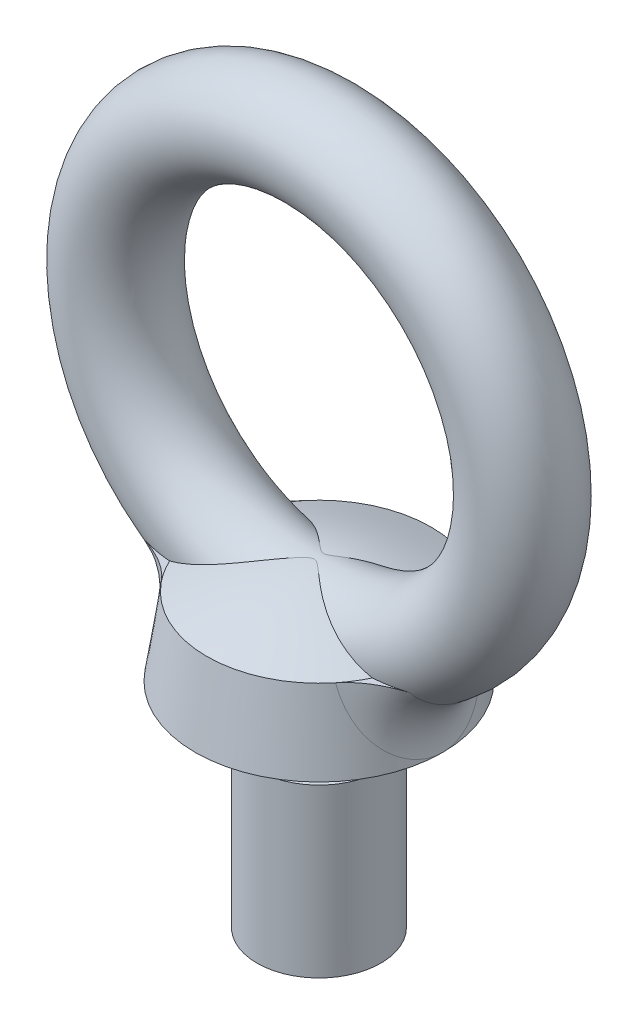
ISO-10303-21;
HEADER;
FILE_DESCRIPTION(('STEP AP214'),'2;1');
FILE_NAME('part.step','',(''),(''),'','','');
FILE_SCHEMA(('AUTOMOTIVE_DESIGN { 1 0 10303 214 1 1 1 1 }'));
ENDSEC;
DATA;
#1=APPLICATION_CONTEXT('core data for automotive mechanical design processes');
#2=APPLICATION_PROTOCOL_DEFINITION('international standard','automotive_design',2000,#1);
#3=PRODUCT_CONTEXT('',#1,'mechanical');
#4=PRODUCT('Part','Part','',(#3));
#5=PRODUCT_RELATED_PRODUCT_CATEGORY('part','',(#4));
#6=PRODUCT_DEFINITION_FORMATION('','',#4);
#7=PRODUCT_DEFINITION_CONTEXT('part definition',#1,'design');
#8=PRODUCT_DEFINITION('design','',#6,#7);
#9=PRODUCT_DEFINITION_SHAPE('','',#8);
#10=(LENGTH_UNIT() NAMED_UNIT(*) SI_UNIT(.MILLI.,.METRE.));
#11=(NAMED_UNIT(*) PLANE_ANGLE_UNIT() SI_UNIT($,.RADIAN.));
#12=(NAMED_UNIT(*) SI_UNIT($,.STERADIAN.) SOLID_ANGLE_UNIT());
#13=UNCERTAINTY_MEASURE_WITH_UNIT(LENGTH_MEASURE(1.E-05),#10,'distance_accuracy_value','');
#14=(GEOMETRIC_REPRESENTATION_CONTEXT(3) GLOBAL_UNCERTAINTY_ASSIGNED_CONTEXT((#13)) GLOBAL_UNIT_ASSIGNED_CONTEXT((#10,
#11,#12)) REPRESENTATION_CONTEXT('',''));
#15=CARTESIAN_POINT('',(0.,0.,0.));
#16=DIRECTION('',(0.,0.,1.));
#17=DIRECTION('',(1.,0.,0.));
#18=AXIS2_PLACEMENT_3D('',#15,#16,#17);
#19=CARTESIAN_POINT('',(0.,-12.,0.));
#20=DIRECTION('',(0.,-1.,0.));
#21=DIRECTION('',(0.,0.,-1.));
#22=AXIS2_PLACEMENT_3D('',#19,#20,#21);
#23=PLANE('',#22);
#24=CARTESIAN_POINT('',(0.,-12.,0.));
#25=DIRECTION('',(0.,1.,0.));
#26=DIRECTION('',(0.,0.,1.));
#27=AXIS2_PLACEMENT_3D('',#24,#25,#26);
#28=CIRCLE('',#27,7.24901914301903);
#29=CARTESIAN_POINT('',(-6.54959985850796,-12.,3.10660912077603));
#30=VERTEX_POINT('',#29);
#31=CARTESIAN_POINT('',(-5.63509053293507,-12.,4.56004750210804));
#32=VERTEX_POINT('',#31);
#33=EDGE_CURVE('E102',#30,#32,#28,.T.);
#34=ORIENTED_EDGE('',*,*,#33,.F.);
#35=CARTESIAN_POINT('',(0.,-12.,-2.93257565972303));
#36=CARTESIAN_POINT('',(0.262298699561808,-12.,-2.93257681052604));
#37=CARTESIAN_POINT('',(0.524597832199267,-12.,-2.93599679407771));
#38=CARTESIAN_POINT('',(1.04903783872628,-12.,-2.94910342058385));
#39=CARTESIAN_POINT('',(1.3111787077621,-12.,-2.95879024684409));
#40=CARTESIAN_POINT('',(1.83568261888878,-12.,-2.98282294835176));
#41=CARTESIAN_POINT('',(2.09804527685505,-12.,-2.99717674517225));
#42=CARTESIAN_POINT('',(2.62263779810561,-12.,-3.02809437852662));
#43=CARTESIAN_POINT('',(2.88486765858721,-12.,-3.04465825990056));
#44=CARTESIAN_POINT('',(3.40985043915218,-12.,-3.07703629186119));
#45=CARTESIAN_POINT('',(3.67260345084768,-12.,-3.09284903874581));
#46=CARTESIAN_POINT('',(4.19832146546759,-12.,-3.12033152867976));
#47=CARTESIAN_POINT('',(4.4612864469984,-12.,-3.13200164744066));
#48=CARTESIAN_POINT('',(4.98696356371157,-12.,-3.14754975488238));
#49=CARTESIAN_POINT('',(5.24967518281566,-12.,-3.15144298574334));
#50=CARTESIAN_POINT('',(5.77507674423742,-12.,-3.14757766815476));
#51=CARTESIAN_POINT('',(6.03776668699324,-12.,-3.13981953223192));
#52=CARTESIAN_POINT('',(6.50469551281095,-12.,-3.11180278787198));
#53=CARTESIAN_POINT('',(6.70911279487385,-12.,-3.09466046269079));
#54=CARTESIAN_POINT('',(7.11655188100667,-12.,-3.04839415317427));
#55=CARTESIAN_POINT('',(7.31957422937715,-12.,-3.0192751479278));
#56=CARTESIAN_POINT('',(7.72244123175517,-12.,-2.94666794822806));
#57=CARTESIAN_POINT('',(7.92229388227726,-12.,-2.90322531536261));
#58=CARTESIAN_POINT('',(8.31740186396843,-12.,-2.79923179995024));
#59=CARTESIAN_POINT('',(8.51266126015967,-12.,-2.73869671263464));
#60=CARTESIAN_POINT('',(8.90210663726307,-12.,-2.59519334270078));
#61=CARTESIAN_POINT('',(9.09605375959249,-12.,-2.51156298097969));
#62=CARTESIAN_POINT('',(9.47144033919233,-12.,-2.31926822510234));
#63=CARTESIAN_POINT('',(9.6528815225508,-12.,-2.21060729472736));
#64=CARTESIAN_POINT('',(9.96691720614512,-12.,-1.98587534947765));
#65=CARTESIAN_POINT('',(10.1025879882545,-12.,-1.87414827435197));
#66=CARTESIAN_POINT('',(10.3541931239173,-12.,-1.63025553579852));
#67=CARTESIAN_POINT('',(10.4701603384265,-12.,-1.49812461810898));
#68=CARTESIAN_POINT('',(10.6516556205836,-12.,-1.2466029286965));
#69=CARTESIAN_POINT('',(10.7226553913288,-12.,-1.13117576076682));
#70=CARTESIAN_POINT('',(10.8447806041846,-12.,-0.890168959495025));
#71=CARTESIAN_POINT('',(10.8959170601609,-12.,-0.764594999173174));
#72=CARTESIAN_POINT('',(10.9751671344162,-12.,-0.50538481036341));
#73=CARTESIAN_POINT('',(11.0031289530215,-12.,-0.371701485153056));
#74=CARTESIAN_POINT('',(11.033209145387,-12.,-0.101456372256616));
#75=CARTESIAN_POINT('',(11.0353393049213,-12.,0.035104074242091));
#76=CARTESIAN_POINT('',(11.0147697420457,-12.,0.291917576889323));
#77=CARTESIAN_POINT('',(10.9946360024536,-12.,0.412386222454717));
#78=CARTESIAN_POINT('',(10.9348862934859,-12.,0.648351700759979));
#79=CARTESIAN_POINT('',(10.895268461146,-12.,0.763848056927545));
#80=CARTESIAN_POINT('',(10.7976138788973,-12.,0.990159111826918));
#81=CARTESIAN_POINT('',(10.7391378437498,-12.,1.1007823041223));
#82=CARTESIAN_POINT('',(10.6070456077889,-12.,1.31249654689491));
#83=CARTESIAN_POINT('',(10.5334241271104,-12.,1.41358425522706));
#84=CARTESIAN_POINT('',(10.3333026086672,-12.,1.6543222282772));
#85=CARTESIAN_POINT('',(10.1989477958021,-12.,1.78745038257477));
#86=CARTESIAN_POINT('',(9.91057339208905,-12.,2.03061452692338));
#87=CARTESIAN_POINT('',(9.7564978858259,-12.,2.14058240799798));
#88=CARTESIAN_POINT('',(9.47452918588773,-12.,2.31472383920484));
#89=CARTESIAN_POINT('',(9.34942668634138,-12.,2.38352317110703));
#90=CARTESIAN_POINT('',(9.0936289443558,-12.,2.50991120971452));
#91=CARTESIAN_POINT('',(8.96293072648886,-12.,2.56749385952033));
#92=CARTESIAN_POINT('',(8.69764073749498,-12.,2.67244248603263));
#93=CARTESIAN_POINT('',(8.56305160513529,-12.,2.71981521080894));
#94=CARTESIAN_POINT('',(8.29105557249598,-12.,2.80544583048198));
#95=CARTESIAN_POINT('',(8.15364906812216,-12.,2.84370499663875));
#96=CARTESIAN_POINT('',(7.85203547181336,-12.,2.91825518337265));
#97=CARTESIAN_POINT('',(7.68743975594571,-12.,2.9529638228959));
#98=CARTESIAN_POINT('',(7.35646893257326,-12.,3.01263801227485));
#99=CARTESIAN_POINT('',(7.19009316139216,-12.,3.03759978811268));
#100=CARTESIAN_POINT('',(6.68905288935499,-12.,3.10002078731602));
#101=CARTESIAN_POINT('',(6.35282856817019,-12.,3.12493537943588));
#102=CARTESIAN_POINT('',(5.67710193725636,-12.,3.15134145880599));
#103=CARTESIAN_POINT('',(5.3375947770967,-12.,3.15264562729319));
#104=CARTESIAN_POINT('',(4.6590194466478,-12.,3.14014525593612));
#105=CARTESIAN_POINT('',(4.31995120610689,-12.,3.12634354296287));
#106=CARTESIAN_POINT('',(3.60120196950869,-12.,3.08945957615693));
#107=CARTESIAN_POINT('',(3.22157582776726,-12.,3.06545577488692));
#108=CARTESIAN_POINT('',(2.65207770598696,-12.,3.03014751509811));
#109=CARTESIAN_POINT('',(2.4622263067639,-12.,3.01849380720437));
#110=CARTESIAN_POINT('',(2.08244907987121,-12.,2.99648839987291));
#111=CARTESIAN_POINT('',(1.8925232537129,-12.,2.98613667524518));
#112=CARTESIAN_POINT('',(1.51277608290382,-12.,2.96768301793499));
#113=CARTESIAN_POINT('',(1.32295486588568,-12.,2.95957853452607));
#114=CARTESIAN_POINT('',(0.943207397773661,-12.,2.94632217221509));
#115=CARTESIAN_POINT('',(0.753281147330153,-12.,2.94117027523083));
#116=CARTESIAN_POINT('',(0.373403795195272,-12.,2.93427754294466));
#117=CARTESIAN_POINT('',(0.18345270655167,-12.,2.93253600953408));
#118=CARTESIAN_POINT('',(-0.196448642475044,-12.,2.9326166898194));
#119=CARTESIAN_POINT('',(-0.386398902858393,-12.,2.93443890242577));
#120=CARTESIAN_POINT('',(-0.765670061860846,-12.,2.94147456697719));
#121=CARTESIAN_POINT('',(-0.954991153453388,-12.,2.94667792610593));
#122=CARTESIAN_POINT('',(-1.33352882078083,-12.,2.96000668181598));
#123=CARTESIAN_POINT('',(-1.5227453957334,-12.,2.96813209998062));
#124=CARTESIAN_POINT('',(-1.90113403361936,-12.,2.98659229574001));
#125=CARTESIAN_POINT('',(-2.09030605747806,-12.,2.99692784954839));
#126=CARTESIAN_POINT('',(-2.46857692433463,-12.,3.01887830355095));
#127=CARTESIAN_POINT('',(-2.65767576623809,-12.,3.03049322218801));
#128=CARTESIAN_POINT('',(-3.22516152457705,-12.,3.06568055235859));
#129=CARTESIAN_POINT('',(-3.60352384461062,-12.,3.08958277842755));
#130=CARTESIAN_POINT('',(-4.36064704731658,-12.,3.1284278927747));
#131=CARTESIAN_POINT('',(-4.73940766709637,-12.,3.14337489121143));
#132=CARTESIAN_POINT('',(-5.34599327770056,-12.,3.15122975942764));
#133=CARTESIAN_POINT('',(-5.5737083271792,-12.,3.15055394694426));
#134=CARTESIAN_POINT('',(-6.0289609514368,-12.,3.13929491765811));
#135=CARTESIAN_POINT('',(-6.25649849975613,-12.,3.12871043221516));
#136=CARTESIAN_POINT('',(-6.70996352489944,-12.,3.09480037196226));
#137=CARTESIAN_POINT('',(-6.93589381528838,-12.,3.07151500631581));
#138=CARTESIAN_POINT('',(-7.38549934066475,-12.,3.00906161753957));
#139=CARTESIAN_POINT('',(-7.60917568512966,-12.,2.9699018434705));
#140=CARTESIAN_POINT('',(-8.09344731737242,-12.,2.86309133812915));
#141=CARTESIAN_POINT('',(-8.35321099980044,-12.,2.79150810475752));
#142=CARTESIAN_POINT('',(-8.861442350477,-12.,2.61420191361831));
#143=CARTESIAN_POINT('',(-9.10990798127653,-12.,2.50847282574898));
#144=CARTESIAN_POINT('',(-9.52167571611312,-12.,2.2895345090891));
#145=CARTESIAN_POINT('',(-9.69000017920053,-12.,2.18586442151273));
#146=CARTESIAN_POINT('',(-10.0087011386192,-12.,1.95385044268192));
#147=CARTESIAN_POINT('',(-10.159114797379,-12.,1.82555913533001));
#148=CARTESIAN_POINT('',(-10.3992381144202,-12.,1.5784732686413));
#149=CARTESIAN_POINT('',(-10.4947259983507,-12.,1.46531110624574));
#150=CARTESIAN_POINT('',(-10.6663662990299,-12.,1.22486958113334));
#151=CARTESIAN_POINT('',(-10.7425240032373,-12.,1.09759409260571));
#152=CARTESIAN_POINT('',(-10.8388122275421,-12.,0.89731820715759));
#153=CARTESIAN_POINT('',(-10.8680272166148,-12.,0.828594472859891));
#154=CARTESIAN_POINT('',(-10.9196801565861,-12.,0.688660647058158));
#155=CARTESIAN_POINT('',(-10.9421218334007,-12.,0.617451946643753));
#156=CARTESIAN_POINT('',(-10.9797206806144,-12.,0.47317755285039));
#157=CARTESIAN_POINT('',(-10.9948826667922,-12.,0.400113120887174));
#158=CARTESIAN_POINT('',(-11.0175916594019,-12.,0.252838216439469));
#159=CARTESIAN_POINT('',(-11.0251400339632,-12.,0.178627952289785));
#160=CARTESIAN_POINT('',(-11.0349261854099,-12.,-0.0219349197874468));
#161=CARTESIAN_POINT('',(-11.0298400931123,-12.,-0.148723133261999));
#162=CARTESIAN_POINT('',(-10.9974924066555,-12.,-0.399327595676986));
#163=CARTESIAN_POINT('',(-10.9702331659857,-12.,-0.523144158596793));
#164=CARTESIAN_POINT('',(-10.8968681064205,-12.,-0.759809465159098));
#165=CARTESIAN_POINT('',(-10.8515211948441,-12.,-0.872896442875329));
#166=CARTESIAN_POINT('',(-10.7445511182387,-12.,-1.091018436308));
#167=CARTESIAN_POINT('',(-10.6829225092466,-12.,-1.19605074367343));
#168=CARTESIAN_POINT('',(-10.5179613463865,-12.,-1.43805140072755));
#169=CARTESIAN_POINT('',(-10.4078936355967,-12.,-1.57043499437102));
#170=CARTESIAN_POINT('',(-10.1678118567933,-12.,-1.81567599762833));
#171=CARTESIAN_POINT('',(-10.0377555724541,-12.,-1.92849097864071));
#172=CARTESIAN_POINT('',(-9.70207843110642,-12.,-2.18156471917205));
#173=CARTESIAN_POINT('',(-9.4887041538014,-12.,-2.31148182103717));
#174=CARTESIAN_POINT('',(-9.04470197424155,-12.,-2.53672383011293));
#175=CARTESIAN_POINT('',(-8.81404773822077,-12.,-2.63199458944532));
#176=CARTESIAN_POINT('',(-8.37472187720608,-12.,-2.78276189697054));
#177=CARTESIAN_POINT('',(-8.16725544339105,-12.,-2.84188079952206));
#178=CARTESIAN_POINT('',(-7.74789241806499,-12.,-2.94196283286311));
#179=CARTESIAN_POINT('',(-7.53599210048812,-12.,-2.98290999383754));
#180=CARTESIAN_POINT('',(-7.10939312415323,-12.,-3.04979872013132));
#181=CARTESIAN_POINT('',(-6.89468896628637,-12.,-3.07570400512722));
#182=CARTESIAN_POINT('',(-6.46411562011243,-12.,-3.11519208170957));
#183=CARTESIAN_POINT('',(-6.2482459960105,-12.,-3.12876988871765));
#184=CARTESIAN_POINT('',(-5.78072200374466,-12.,-3.1475664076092));
#185=CARTESIAN_POINT('',(-5.52900369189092,-12.,-3.15104950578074));
#186=CARTESIAN_POINT('',(-5.02567858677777,-12.,-3.14842122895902));
#187=CARTESIAN_POINT('',(-4.77407178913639,-12.,-3.14231027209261));
#188=CARTESIAN_POINT('',(-4.27071796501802,-12.,-3.12383678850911));
#189=CARTESIAN_POINT('',(-4.01897133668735,-12.,-3.1114644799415));
#190=CARTESIAN_POINT('',(-3.51564768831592,-12.,-3.08359918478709));
#191=CARTESIAN_POINT('',(-3.26407068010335,-12.,-3.06810599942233));
#192=CARTESIAN_POINT('',(-2.76150329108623,-12.,-3.03693328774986));
#193=CARTESIAN_POINT('',(-2.51051287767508,-12.,-3.02125426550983));
#194=CARTESIAN_POINT('',(-2.00839497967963,-12.,-2.99223669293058));
#195=CARTESIAN_POINT('',(-1.75726749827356,-12.,-2.97889809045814));
#196=CARTESIAN_POINT('',(-1.25518647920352,-12.,-2.95665683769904));
#197=CARTESIAN_POINT('',(-1.0042332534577,-12.,-2.94774750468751));
#198=CARTESIAN_POINT('',(-0.502186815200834,-12.,-2.93570643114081));
#199=CARTESIAN_POINT('',(-0.251093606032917,-12.,-2.93257455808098));
#200=CARTESIAN_POINT('',(0.,-12.,-2.93257565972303));
#201=B_SPLINE_CURVE_WITH_KNOTS('',3,(#35,#36,#37,#38,#39,#40,#41,#42,#43,#44,#45,#46,#47,#48,
#49,#50,#51,#52,#53,#54,#55,#56,#57,#58,#59,#60,#61,#62,#63,#64,#65,#66,#67,#68,#69,#70,#71,#72,
#73,#74,#75,#76,#77,#78,#79,#80,#81,#82,#83,#84,#85,#86,#87,#88,#89,#90,#91,#92,#93,#94,#95,#96,
#97,#98,#99,#100,#101,#102,#103,#104,#105,#106,#107,#108,#109,#110,#111,#112,#113,#114,#115,
#116,#117,#118,#119,#120,#121,#122,#123,#124,#125,#126,#127,#128,#129,#130,#131,#132,#133,#134,
#135,#136,#137,#138,#139,#140,#141,#142,#143,#144,#145,#146,#147,#148,#149,#150,#151,#152,#153,
#154,#155,#156,#157,#158,#159,#160,#161,#162,#163,#164,#165,#166,#167,#168,#169,#170,#171,#172,
#173,#174,#175,#176,#177,#178,#179,#180,#181,#182,#183,#184,#185,#186,#187,#188,#189,#190,#191,
#192,#193,#194,#195,#196,#197,#198,#199,#200),.UNSPECIFIED.,.T.,.F.,(4,2,2,2,2,2,2,2,2,2,2,2,2,
2,2,2,2,2,2,2,2,2,2,2,2,2,2,2,2,2,2,2,2,2,2,2,2,2,2,2,2,2,2,2,2,2,2,2,2,2,2,2,2,2,2,2,2,2,2,2,2,
2,2,2,2,2,2,2,2,2,2,2,2,2,2,2,2,2,2,2,2,2,4),(0.,0.786877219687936,1.57377745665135,
2.36202038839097,3.15027931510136,3.93995761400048,4.72956427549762,5.51762183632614,
6.30565149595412,6.92077599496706,7.53564502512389,8.1485768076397,8.76094401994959,
9.39311193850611,10.0251924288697,10.5506208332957,11.075164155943,11.4801153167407,
11.884841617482,12.2921984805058,12.6993694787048,13.0640825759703,13.4288305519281,
13.8027765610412,14.1768531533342,14.7411051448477,15.3069939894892,15.7347350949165,
16.1627065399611,16.5903942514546,17.0180222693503,17.5223108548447,18.0267945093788,
19.0368427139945,20.0549008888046,21.0727685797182,22.2139135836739,22.7845394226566,
23.355154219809,23.9251186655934,24.4950796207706,25.0649238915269,25.6347679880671,
26.2029188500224,26.7710739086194,27.339428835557,27.9077919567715,29.0451608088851,
30.182007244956,30.8649952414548,31.5480706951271,32.228996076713,32.9095680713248,
33.7161391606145,34.5228551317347,35.1141196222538,35.7041351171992,36.1467722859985,
36.589288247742,36.8130234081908,37.0366352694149,37.2600989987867,37.4835225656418,
37.8620409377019,38.2405191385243,38.6045541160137,38.9687109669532,39.4823238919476,
39.9970368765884,40.7422997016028,41.4887223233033,42.1349515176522,42.7817475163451,
43.4300971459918,44.0787088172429,44.8336691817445,45.5885966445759,46.3447071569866,
47.1008658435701,47.855304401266,48.6097261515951,49.3630061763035,50.1162689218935),.UNSPECIFIED.);
#202=CARTESIAN_POINT('',(-8.58038294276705,-12.,2.71218300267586));
#203=VERTEX_POINT('',#202);
#204=EDGE_CURVE('E241',#30,#203,#201,.T.);
#205=ORIENTED_EDGE('',*,*,#204,.T.);
#206=CARTESIAN_POINT('',(-5.01408731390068,-5.77298728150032,3.83696661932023));
#207=CARTESIAN_POINT('',(-6.95086320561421,-6.50196739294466,1.48618482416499));
#208=CARTESIAN_POINT('',(-9.80326853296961,-6.22524872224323,2.7494736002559));
#209=CARTESIAN_POINT('',(-5.01989676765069,-5.98136064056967,3.88089226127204));
#210=CARTESIAN_POINT('',(-6.92103775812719,-6.68261909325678,1.59451185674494));
#211=CARTESIAN_POINT('',(-9.72739766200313,-6.43226602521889,2.7757021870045));
#212=CARTESIAN_POINT('',(-5.02561946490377,-6.18995342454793,3.92456482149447));
#213=CARTESIAN_POINT('',(-6.89121706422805,-6.86249480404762,1.70013671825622));
#214=CARTESIAN_POINT('',(-9.65073374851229,-6.63358641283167,2.80163713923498));
#215=CARTESIAN_POINT('',(-5.0377894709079,-6.60806334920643,4.01054390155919));
#216=CARTESIAN_POINT('',(-6.83328983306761,-7.21804809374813,1.90265779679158));
#217=CARTESIAN_POINT('',(-9.49786544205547,-7.02545863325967,2.85232323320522));
#218=CARTESIAN_POINT('',(-5.04423726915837,-6.81758102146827,4.05284947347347));
#219=CARTESIAN_POINT('',(-6.80512080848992,-7.39400635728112,1.99981697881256));
#220=CARTESIAN_POINT('',(-9.42166139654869,-7.21600305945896,2.87707355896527));
#221=CARTESIAN_POINT('',(-5.05887345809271,-7.24131429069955,4.1358721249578));
#222=CARTESIAN_POINT('',(-6.75101662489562,-7.74580703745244,2.18617335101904));
#223=CARTESIAN_POINT('',(-9.27059437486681,-7.58981835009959,2.92516172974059));
#224=CARTESIAN_POINT('',(-5.06708956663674,-7.45554921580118,4.17654999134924));
#225=CARTESIAN_POINT('',(-6.72503947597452,-7.92193972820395,2.2755148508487));
#226=CARTESIAN_POINT('',(-9.19577619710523,-7.77291057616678,2.94846842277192));
#227=CARTESIAN_POINT('',(-5.08630042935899,-7.88536648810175,4.254468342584));
#228=CARTESIAN_POINT('',(-6.67695893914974,-8.27182768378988,2.44355610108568));
#229=CARTESIAN_POINT('',(-9.05106978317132,-8.12880030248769,2.99248220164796));
#230=CARTESIAN_POINT('',(-5.09729468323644,-8.1009485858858,4.29170944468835));
#231=CARTESIAN_POINT('',(-6.6547643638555,-8.44588663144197,2.52253415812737));
#232=CARTESIAN_POINT('',(-8.98118066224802,-8.30159964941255,3.01318975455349));
#233=CARTESIAN_POINT('',(-5.123606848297,-8.53883795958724,4.36241674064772));
#234=CARTESIAN_POINT('',(-6.61490705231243,-8.79627435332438,2.67075336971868));
#235=CARTESIAN_POINT('',(-8.84689808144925,-8.64151904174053,3.05168240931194));
#236=CARTESIAN_POINT('',(-5.13902456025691,-8.76118011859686,4.39576739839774));
#237=CARTESIAN_POINT('',(-6.59726487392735,-8.9729388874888,2.7400053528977));
#238=CARTESIAN_POINT('',(-8.7826823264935,-8.80839445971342,3.06938299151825));
#239=CARTESIAN_POINT('',(-5.17547489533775,-9.20702288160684,4.45611875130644));
#240=CARTESIAN_POINT('',(-6.56849029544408,-9.32416795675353,2.86530514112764));
#241=CARTESIAN_POINT('',(-8.66405654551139,-9.13220993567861,3.10026417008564));
#242=CARTESIAN_POINT('',(-5.19650858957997,-9.43052369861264,4.48311823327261));
#243=CARTESIAN_POINT('',(-6.55726559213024,-9.49908132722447,2.92160262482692));
#244=CARTESIAN_POINT('',(-8.6096483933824,-9.28914809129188,3.11344390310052));
#245=CARTESIAN_POINT('',(-5.24539482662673,-9.87616374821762,4.52891993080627));
#246=CARTESIAN_POINT('',(-6.54252076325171,-9.84487779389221,3.0194112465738));
#247=CARTESIAN_POINT('',(-8.51314386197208,-9.59211056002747,3.13414516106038));
#248=CARTESIAN_POINT('',(-5.2731978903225,-10.098301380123,4.54777899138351));
#249=CARTESIAN_POINT('',(-6.53887090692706,-10.0161245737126,3.06123218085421));
#250=CARTESIAN_POINT('',(-8.47096280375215,-9.73820445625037,3.14170619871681));
#251=CARTESIAN_POINT('',(-5.33681400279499,-10.5411480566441,4.57581642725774));
#252=CARTESIAN_POINT('',(-6.539924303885,-10.3544841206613,3.12946102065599));
#253=CARTESIAN_POINT('',(-8.4001185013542,-10.0205306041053,3.15024026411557));
#254=CARTESIAN_POINT('',(-5.37262084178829,-10.7618580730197,4.58500227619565));
#255=CARTESIAN_POINT('',(-6.54457067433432,-10.5219546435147,3.15604213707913));
#256=CARTESIAN_POINT('',(-8.37144483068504,-10.1567703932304,3.15121838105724));
#257=CARTESIAN_POINT('',(-5.44499132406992,-11.1567226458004,4.59134509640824));
#258=CARTESIAN_POINT('',(-6.56067849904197,-10.8188155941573,3.18937554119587));
#259=CARTESIAN_POINT('',(-8.33274395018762,-10.3934262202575,3.14615216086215));
#260=CARTESIAN_POINT('',(-5.48002048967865,-11.3314946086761,4.59051286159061));
#261=CARTESIAN_POINT('',(-6.57060290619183,-10.949318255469,3.1990500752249));
#262=CARTESIAN_POINT('',(-8.32015828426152,-10.4956172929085,3.14145139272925));
#263=CARTESIAN_POINT('',(-5.55570684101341,-11.6776470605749,4.58078464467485));
#264=CARTESIAN_POINT('',(-6.59575485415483,-11.2056755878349,3.20778519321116));
#265=CARTESIAN_POINT('',(-8.30431233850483,-10.6935156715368,3.12673114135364));
#266=CARTESIAN_POINT('',(-5.59636839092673,-11.8490248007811,4.57188237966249));
#267=CARTESIAN_POINT('',(-6.61099045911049,-11.3316918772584,3.20686543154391));
#268=CARTESIAN_POINT('',(-8.30105933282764,-10.7892178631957,3.11670751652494));
#269=CARTESIAN_POINT('',(-5.68259616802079,-12.1853277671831,4.54555740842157));
#270=CARTESIAN_POINT('',(-6.64605697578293,-11.5767841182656,3.19455620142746));
#271=CARTESIAN_POINT('',(-8.30348625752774,-10.9731187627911,3.09115286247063));
#272=CARTESIAN_POINT('',(-5.72811475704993,-12.3502973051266,4.52821241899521));
#273=CARTESIAN_POINT('',(-6.66585999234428,-11.6960531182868,3.18326450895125));
#274=CARTESIAN_POINT('',(-8.30908573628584,-11.0613774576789,3.07567241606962));
#275=CARTESIAN_POINT('',(-5.82373862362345,-12.6741026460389,4.48471356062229));
#276=CARTESIAN_POINT('',(-6.70931839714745,-11.9279282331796,3.15077077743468));
#277=CARTESIAN_POINT('',(-8.32826659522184,-11.2313274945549,3.03904454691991));
#278=CARTESIAN_POINT('',(-5.87384298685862,-12.832939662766,4.45856144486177));
#279=CARTESIAN_POINT('',(-6.73299526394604,-12.0406514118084,3.12955331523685));
#280=CARTESIAN_POINT('',(-8.34184638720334,-11.3130201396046,3.01789825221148));
#281=CARTESIAN_POINT('',(-5.9779690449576,-13.1439122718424,4.3972395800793));
#282=CARTESIAN_POINT('',(-6.78328390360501,-12.2590753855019,3.07781986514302));
#283=CARTESIAN_POINT('',(-8.37594079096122,-11.4701972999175,2.96984993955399));
#284=CARTESIAN_POINT('',(-6.03200204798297,-13.2960263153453,4.36204299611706));
#285=CARTESIAN_POINT('',(-6.80992937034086,-12.3648421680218,3.04724369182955));
#286=CARTESIAN_POINT('',(-8.39647609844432,-11.5456624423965,2.94293083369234));
#287=CARTESIAN_POINT('',(-6.14286048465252,-13.5922323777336,4.28276342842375));
#288=CARTESIAN_POINT('',(-6.86502670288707,-12.5685356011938,2.97772202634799));
#289=CARTESIAN_POINT('',(-8.44318668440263,-11.6903182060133,2.88348555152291));
#290=CARTESIAN_POINT('',(-6.19968710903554,-13.7363209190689,4.23867663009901));
#291=CARTESIAN_POINT('',(-6.8935029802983,-12.6665191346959,2.93873173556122));
#292=CARTESIAN_POINT('',(-8.46936438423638,-11.7595061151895,2.85095696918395));
#293=CARTESIAN_POINT('',(-6.37311242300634,-14.1564277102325,4.09308033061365));
#294=CARTESIAN_POINT('',(-6.98028676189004,-12.949156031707,2.81029948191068));
#295=CARTESIAN_POINT('',(-8.55450376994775,-11.9584331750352,2.74499816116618));
#296=CARTESIAN_POINT('',(-6.49239534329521,-14.4195301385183,3.97838427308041));
#297=CARTESIAN_POINT('',(-7.03971175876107,-13.1214503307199,2.70958399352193));
#298=CARTESIAN_POINT('',(-8.61997673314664,-12.0791586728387,2.66331214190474));
#299=CARTESIAN_POINT('',(-6.72776019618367,-14.9048228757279,3.7189016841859));
#300=CARTESIAN_POINT('',(-7.15332063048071,-13.4311989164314,2.48901009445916));
#301=CARTESIAN_POINT('',(-8.75689784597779,-12.2972617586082,2.48152205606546));
#302=CARTESIAN_POINT('',(-6.84386360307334,-15.1275124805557,3.5745373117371));
#303=CARTESIAN_POINT('',(-7.2076064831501,-13.5690651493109,2.36914473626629));
#304=CARTESIAN_POINT('',(-8.82825455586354,-12.3949295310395,2.38167843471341));
#305=CARTESIAN_POINT('',(-7.06739189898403,-15.5357318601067,3.25852686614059));
#306=CARTESIAN_POINT('',(-7.30753358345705,-13.8152617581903,2.11693082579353));
#307=CARTESIAN_POINT('',(-8.96961928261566,-12.5712131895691,2.16531384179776));
#308=CARTESIAN_POINT('',(-7.17482102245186,-15.7212798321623,3.08689422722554));
#309=CARTESIAN_POINT('',(-7.3531244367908,-13.923408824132,1.98446316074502));
#310=CARTESIAN_POINT('',(-9.03962794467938,-12.6498384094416,2.04880108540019));
#311=CARTESIAN_POINT('',(-7.38522949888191,-16.0720074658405,2.70181368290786));
#312=CARTESIAN_POINT('',(-7.43788816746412,-14.1227080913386,1.69930166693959));
#313=CARTESIAN_POINT('',(-9.17882530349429,-12.7967856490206,1.78913310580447));
#314=CARTESIAN_POINT('',(-7.4866631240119,-16.2332362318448,2.48589314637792));
#315=CARTESIAN_POINT('',(-7.47578011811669,-14.2106280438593,1.54607627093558));
#316=CARTESIAN_POINT('',(-9.24721678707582,-12.863264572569,1.64447549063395));
#317=CARTESIAN_POINT('',(-7.6653895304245,-16.5101622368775,2.03199866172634));
#318=CARTESIAN_POINT('',(-7.53885265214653,-14.3580312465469,1.23764759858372));
#319=CARTESIAN_POINT('',(-9.36870209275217,-12.9765258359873,1.34183324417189));
#320=CARTESIAN_POINT('',(-7.74269930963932,-16.6258915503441,1.7940403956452));
#321=CARTESIAN_POINT('',(-7.56389921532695,-14.417209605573,1.08267962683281));
#322=CARTESIAN_POINT('',(-9.42180668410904,-13.0233220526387,1.18385809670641));
#323=CARTESIAN_POINT('',(-7.84721959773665,-16.7800577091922,1.38628244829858));
#324=CARTESIAN_POINT('',(-7.59625573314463,-14.4946660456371,0.826191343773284));
#325=CARTESIAN_POINT('',(-9.49387403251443,-13.0853678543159,0.913932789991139));
#326=CARTESIAN_POINT('',(-7.8825295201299,-16.8313971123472,1.2207121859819));
#327=CARTESIAN_POINT('',(-7.6066806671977,-14.5199654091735,0.724332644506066));
#328=CARTESIAN_POINT('',(-9.51830826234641,-13.1059339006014,0.804527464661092));
#329=CARTESIAN_POINT('',(-7.9397269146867,-16.9140210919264,0.885011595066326));
#330=CARTESIAN_POINT('',(-7.6231903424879,-14.5603501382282,0.521094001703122));
#331=CARTESIAN_POINT('',(-9.55794893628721,-13.1389631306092,0.582971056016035));
#332=CARTESIAN_POINT('',(-7.96161464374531,-16.9453060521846,0.714881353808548));
#333=CARTESIAN_POINT('',(-7.62925508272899,-14.5753875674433,0.419830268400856));
#334=CARTESIAN_POINT('',(-9.57315555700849,-13.1514264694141,0.470820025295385));
#335=CARTESIAN_POINT('',(-7.99945557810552,-16.9993119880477,0.278491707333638));
#336=CARTESIAN_POINT('',(-7.6396956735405,-14.601335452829,0.162191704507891));
#337=CARTESIAN_POINT('',(-9.59945438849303,-13.1729310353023,0.183322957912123));
#338=CARTESIAN_POINT('',(-8.00564050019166,-17.0080262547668,0.0104731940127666));
#339=CARTESIAN_POINT('',(-7.64130602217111,-14.605422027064,0.00643902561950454));
#340=CARTESIAN_POINT('',(-9.6037647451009,-13.1763865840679,0.00691232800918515));
#341=CARTESIAN_POINT('',(-7.98391584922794,-16.9771338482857,-0.523082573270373));
#342=CARTESIAN_POINT('',(-7.63540194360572,-14.5906681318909,-0.306185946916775));
#343=CARTESIAN_POINT('',(-9.58865431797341,-13.1641000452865,-0.344427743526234));
#344=CARTESIAN_POINT('',(-7.95596798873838,-16.9374729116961,-0.788616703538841));
#345=CARTESIAN_POINT('',(-7.62789480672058,-14.5718458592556,-0.462590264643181));
#346=CARTESIAN_POINT('',(-9.56920688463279,-13.1483363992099,-0.519355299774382));
#347=CARTESIAN_POINT('',(-7.86774254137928,-16.810045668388,-1.30855458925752));
#348=CARTESIAN_POINT('',(-7.60242402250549,-14.5095650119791,-0.777310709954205));
#349=CARTESIAN_POINT('',(-9.50805809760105,-13.0974002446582,-0.862498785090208));
#350=CARTESIAN_POINT('',(-7.80748917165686,-16.7223153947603,-1.56296652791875));
#351=CARTESIAN_POINT('',(-7.58454245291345,-14.4663029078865,-0.935189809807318));
#352=CARTESIAN_POINT('',(-9.46637341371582,-13.0622422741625,-1.03071964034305));
#353=CARTESIAN_POINT('',(-7.65847882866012,-16.4991740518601,-2.05307668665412));
#354=CARTESIAN_POINT('',(-7.53626228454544,-14.3519513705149,-1.25165213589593));
#355=CARTESIAN_POINT('',(-9.36404746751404,-12.9719925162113,-1.35586698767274));
#356=CARTESIAN_POINT('',(-7.56972851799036,-16.3637741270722,-2.28877926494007));
#357=CARTESIAN_POINT('',(-7.50599588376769,-14.2811633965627,-1.40988980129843));
#358=CARTESIAN_POINT('',(-9.30341063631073,-12.9169053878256,-1.51279610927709));
#359=CARTESIAN_POINT('',(-7.36877189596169,-16.0446594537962,-2.73604333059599));
#360=CARTESIAN_POINT('',(-7.43137576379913,-14.1071787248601,-1.72370140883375));
#361=CARTESIAN_POINT('',(-9.16794383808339,-12.7853283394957,-1.81212762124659));
#362=CARTESIAN_POINT('',(-7.25641459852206,-15.8606316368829,-2.94743516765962));
#363=CARTESIAN_POINT('',(-7.38708932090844,-14.0041383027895,-1.87907538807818));
#364=CARTESIAN_POINT('',(-9.09302281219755,-12.7086995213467,-1.9544272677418));
#365=CARTESIAN_POINT('',(-7.01601636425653,-15.4445299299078,-3.33821508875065));
#366=CARTESIAN_POINT('',(-7.28533850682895,-13.7612752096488,-2.1785502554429));
#367=CARTESIAN_POINT('',(-8.93664917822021,-12.5321822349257,-2.2195553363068));
#368=CARTESIAN_POINT('',(-6.88796308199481,-15.2124181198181,-3.51757770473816));
#369=CARTESIAN_POINT('',(-7.22799295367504,-13.621777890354,-2.3226936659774));
#370=CARTESIAN_POINT('',(-8.85519144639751,-12.4322754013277,-2.34236825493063));
#371=CARTESIAN_POINT('',(-6.6921403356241,-14.8302410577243,-3.75732865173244));
#372=CARTESIAN_POINT('',(-7.13593198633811,-13.3829637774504,-2.52199991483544));
#373=CARTESIAN_POINT('',(-8.7364524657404,-12.2635689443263,-2.50851670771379));
#374=CARTESIAN_POINT('',(-6.62649877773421,-14.6977477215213,-3.83213399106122));
#375=CARTESIAN_POINT('',(-7.10446517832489,-13.2990837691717,-2.58526137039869));
#376=CARTESIAN_POINT('',(-8.69758866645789,-12.2044523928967,-2.56072310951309));
#377=CARTESIAN_POINT('',(-6.49512928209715,-14.4214010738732,-3.97181153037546));
#378=CARTESIAN_POINT('',(-7.04054273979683,-13.1213508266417,-2.7048806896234));
#379=CARTESIAN_POINT('',(-8.62245131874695,-12.0794346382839,-2.65899138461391));
#380=CARTESIAN_POINT('',(-6.42940140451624,-14.277553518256,-4.03668871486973));
#381=CARTESIAN_POINT('',(-7.00807795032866,-13.0275028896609,-2.76129261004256));
#382=CARTESIAN_POINT('',(-8.58617647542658,-12.0135368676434,-2.70505633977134));
#383=CARTESIAN_POINT('',(-6.29943847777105,-13.9792484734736,-4.15582748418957));
#384=CARTESIAN_POINT('',(-6.94343147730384,-12.8300349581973,-2.86560807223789));
#385=CARTESIAN_POINT('',(-8.5180122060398,-11.8747113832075,-2.79055909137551));
#386=CARTESIAN_POINT('',(-6.2351999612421,-13.8248198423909,-4.21011650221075));
#387=CARTESIAN_POINT('',(-6.91122917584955,-12.7264135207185,-2.91359146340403));
#388=CARTESIAN_POINT('',(-8.48611151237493,-11.8018025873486,-2.83001397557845));
#389=CARTESIAN_POINT('',(-6.10949684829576,-13.5056606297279,-4.30788647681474));
#390=CARTESIAN_POINT('',(-6.84842147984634,-12.5094293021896,-2.9997776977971));
#391=CARTESIAN_POINT('',(-8.42840716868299,-11.648414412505,-2.9021345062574));
#392=CARTESIAN_POINT('',(-6.04803186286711,-13.3409315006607,-4.35136895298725));
#393=CARTESIAN_POINT('',(-6.81778651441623,-12.3960039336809,-3.03804080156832));
#394=CARTESIAN_POINT('',(-8.40260266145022,-11.5679361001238,-2.93480110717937));
#395=CARTESIAN_POINT('',(-5.9345207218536,-13.0171061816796,-4.42396606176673));
#396=CARTESIAN_POINT('',(-6.76215807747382,-12.1703902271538,-3.10060496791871));
#397=CARTESIAN_POINT('',(-8.36082282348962,-11.4065426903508,-2.99057173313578));
#398=CARTESIAN_POINT('',(-5.88212192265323,-12.8587937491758,-4.45400942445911));
#399=CARTESIAN_POINT('',(-6.736881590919,-12.0589049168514,-3.12587572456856));
#400=CARTESIAN_POINT('',(-8.34418149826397,-11.3262916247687,-3.01426491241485));
#401=CARTESIAN_POINT('',(-5.78174200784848,-12.5354524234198,-4.50497077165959));
#402=CARTESIAN_POINT('',(-6.68996504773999,-11.8290223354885,-3.16642460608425));
#403=CARTESIAN_POINT('',(-8.3186990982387,-11.1590882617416,-3.05580385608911));
#404=CARTESIAN_POINT('',(-5.73376070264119,-12.3704238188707,-4.52588914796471));
#405=CARTESIAN_POINT('',(-6.66829999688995,-11.710515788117,-3.18172798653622));
#406=CARTESIAN_POINT('',(-8.30985768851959,-11.0721362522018,-3.07364987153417));
#407=CARTESIAN_POINT('',(-5.64274763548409,-12.0341670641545,-4.55892778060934));
#408=CARTESIAN_POINT('',(-6.62944078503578,-11.4669967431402,-3.20187159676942));
#409=CARTESIAN_POINT('',(-8.30092042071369,-10.8910970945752,-3.10365927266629));
#410=CARTESIAN_POINT('',(-5.59973841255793,-11.8629149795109,-4.57100920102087));
#411=CARTESIAN_POINT('',(-6.61224749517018,-11.3418191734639,-3.20667113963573));
#412=CARTESIAN_POINT('',(-8.30086293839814,-10.7969804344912,-3.11579749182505));
#413=CARTESIAN_POINT('',(-5.51935667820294,-11.5163325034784,-4.58672480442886));
#414=CARTESIAN_POINT('',(-6.58311269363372,-11.0865694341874,-3.20548962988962));
#415=CARTESIAN_POINT('',(-8.31016325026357,-10.6020306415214,-3.13453102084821));
#416=CARTESIAN_POINT('',(-5.48198353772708,-11.341002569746,-4.59035993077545));
#417=CARTESIAN_POINT('',(-6.57116200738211,-10.9563349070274,-3.19949050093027));
#418=CARTESIAN_POINT('',(-8.31951999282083,-10.5011982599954,-3.14112694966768));
#419=CARTESIAN_POINT('',(-5.40413979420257,-10.9423821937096,-4.589831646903));
#420=CARTESIAN_POINT('',(-6.5504897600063,-10.6581383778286,-3.17393319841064));
#421=CARTESIAN_POINT('',(-8.35140390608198,-10.2662527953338,-3.15020275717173));
#422=CARTESIAN_POINT('',(-5.36532369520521,-10.7182995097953,-4.58343468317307));
#423=CARTESIAN_POINT('',(-6.54339644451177,-10.4888716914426,-3.15122679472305));
#424=CARTESIAN_POINT('',(-8.37668854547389,-10.1302259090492,-3.15119751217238));
#425=CARTESIAN_POINT('',(-5.29620753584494,-10.2680277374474,-4.56013713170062));
#426=CARTESIAN_POINT('',(-6.53790158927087,-10.146276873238,-3.08987367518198));
#427=CARTESIAN_POINT('',(-8.44161646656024,-9.84784622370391,-3.14607748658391));
#428=CARTESIAN_POINT('',(-5.26591814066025,-10.0418363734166,-4.54322347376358));
#429=CARTESIAN_POINT('',(-6.53955597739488,-9.97257000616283,-3.05105142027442));
#430=CARTESIAN_POINT('',(-8.48127758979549,-9.7014807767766,-3.13995385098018));
#431=CARTESIAN_POINT('',(-5.21300389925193,-9.59100528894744,-4.50089847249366));
#432=CARTESIAN_POINT('',(-6.55075888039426,-9.62405480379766,-2.95907363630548));
#433=CARTESIAN_POINT('',(-8.57300858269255,-9.39977195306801,-3.12178941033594));
#434=CARTESIAN_POINT('',(-5.19032621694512,-9.36636594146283,-4.47554824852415));
#435=CARTESIAN_POINT('',(-6.56032486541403,-9.44888503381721,-2.90581226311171));
#436=CARTESIAN_POINT('',(-8.62498845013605,-9.24449961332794,-3.10979087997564));
#437=CARTESIAN_POINT('',(-5.15102351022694,-8.91867342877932,-4.41811061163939));
#438=CARTESIAN_POINT('',(-6.58606332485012,-9.0974444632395,-2.78635488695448));
#439=CARTESIAN_POINT('',(-8.73917191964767,-8.92442246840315,-3.08101457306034));
#440=CARTESIAN_POINT('',(-5.13437948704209,-8.69561749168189,-4.38604485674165));
#441=CARTESIAN_POINT('',(-6.60230583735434,-8.92081927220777,-2.71995357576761));
#442=CARTESIAN_POINT('',(-8.80134251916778,-8.75964951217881,-3.06425209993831));
#443=CARTESIAN_POINT('',(-5.120027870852,-8.47345435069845,-4.35142716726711));
#444=CARTESIAN_POINT('',(-6.62118044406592,-8.74480162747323,-2.64805637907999));
#445=CARTESIAN_POINT('',(-8.8676181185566,-8.58982214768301,-3.0456234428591));
#446=(BOUNDED_SURFACE() B_SPLINE_SURFACE(3,2,((#206,#207,#208),(#209,#210,#211),(#212,#213,
#214),(#215,#216,#217),(#218,#219,#220),(#221,#222,#223),(#224,#225,#226),(#227,#228,#229),
(#230,#231,#232),(#233,#234,#235),(#236,#237,#238),(#239,#240,#241),(#242,#243,#244),(#245,#246,
#247),(#248,#249,#250),(#251,#252,#253),(#254,#255,#256),(#257,#258,#259),(#260,#261,#262),
(#263,#264,#265),(#266,#267,#268),(#269,#270,#271),(#272,#273,#274),(#275,#276,#277),(#278,#279,
#280),(#281,#282,#283),(#284,#285,#286),(#287,#288,#289),(#290,#291,#292),(#293,#294,#295),
(#296,#297,#298),(#299,#300,#301),(#302,#303,#304),(#305,#306,#307),(#308,#309,#310),(#311,#312,
#313),(#314,#315,#316),(#317,#318,#319),(#320,#321,#322),(#323,#324,#325),(#326,#327,#328),
(#329,#330,#331),(#332,#333,#334),(#335,#336,#337),(#338,#339,#340),(#341,#342,#343),(#344,#345,
#346),(#347,#348,#349),(#350,#351,#352),(#353,#354,#355),(#356,#357,#358),(#359,#360,#361),
(#362,#363,#364),(#365,#366,#367),(#368,#369,#370),(#371,#372,#373),(#374,#375,#376),(#377,#378,
#379),(#380,#381,#382),(#383,#384,#385),(#386,#387,#388),(#389,#390,#391),(#392,#393,#394),
(#395,#396,#397),(#398,#399,#400),(#401,#402,#403),(#404,#405,#406),(#407,#408,#409),(#410,#411,
#412),(#413,#414,#415),(#416,#417,#418),(#419,#420,#421),(#422,#423,#424),(#425,#426,#427),
(#428,#429,#430),(#431,#432,#433),(#434,#435,#436),(#437,#438,#439),(#440,#441,#442),(#443,#444,
#445)),.UNSPECIFIED.,.F.,.F.,.F.) B_SPLINE_SURFACE_WITH_KNOTS((4,2,2,2,2,2,2,2,2,2,2,2,2,2,2,2,
2,2,2,2,2,2,2,2,2,2,2,2,2,2,2,2,2,2,2,2,2,2,2,4),(3,3),(0.,0.650436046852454,1.30131385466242,
1.96325282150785,2.62507266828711,3.30318939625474,3.98143555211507,4.65486568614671,
5.32777513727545,5.86831351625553,6.40927309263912,6.94534460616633,7.48130946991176,
8.01888328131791,8.55668824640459,9.6348922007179,10.6987018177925,11.7619889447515,
12.9326850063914,14.1025543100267,14.8759788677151,15.6493886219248,16.8451565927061,
18.0422671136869,19.2384814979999,20.434416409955,21.6382467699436,22.8430301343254,
23.4408940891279,24.0384568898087,24.6344502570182,25.230359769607,25.7737325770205,
26.317082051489,26.8628052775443,27.4084675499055,28.0937570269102,28.7798998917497,
29.4611763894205,30.1402886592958),(0.,1.),
.UNSPECIFIED.) GEOMETRIC_REPRESENTATION_ITEM() RATIONAL_B_SPLINE_SURFACE(((1.,0.787366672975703,
1.),(1.,0.794761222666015,1.),(1.,0.801960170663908,1.),(1.,0.815881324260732,1.),(1.,
0.822603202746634,1.),(1.,0.835583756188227,1.),(1.,0.841832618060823,1.),(1.,0.853662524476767,
1.),(1.,0.859243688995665,1.),(1.,0.869803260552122,1.),(1.,0.874763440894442,1.),(1.,
0.883858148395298,1.),(1.,0.887992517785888,1.),(1.,0.89536174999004,1.),(1.,0.898602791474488,
1.),(1.,0.904195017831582,1.),(1.,0.906546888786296,1.),(1.,0.909990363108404,1.),(1.,
0.911238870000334,1.),(1.,0.913185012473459,1.),(1.,0.913882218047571,1.),(1.,0.914754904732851,
1.),(1.,0.914935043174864,1.),(1.,0.914835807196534,1.),(1.,0.914556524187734,1.),(1.,
0.913596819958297,1.),(1.,0.912915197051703,1.),(1.,0.911216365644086,1.),(1.,0.910199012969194,
1.),(1.,0.906738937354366,1.),(1.,0.903891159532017,1.),(1.,0.897690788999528,1.),(1.,
0.894345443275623,1.),(1.,0.887556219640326,1.),(1.,0.884112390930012,1.),(1.,0.877148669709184,
1.),(1.,0.873656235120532,1.),(1.,0.8673747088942,1.),(1.,0.864585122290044,1.),(1.,
0.860771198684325,1.),(1.,0.859469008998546,1.),(1.,0.857349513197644,1.),(1.,0.856532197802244,
1.),(1.,0.855117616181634,1.),(1.,0.854884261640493,1.),(1.,0.855698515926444,1.),(1.,
0.856747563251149,1.),(1.,0.86001707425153,1.),(1.,0.862236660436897,1.),(1.,0.86761279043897,
1.),(1.,0.870769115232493,1.),(1.,0.877695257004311,1.),(1.,0.881468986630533,1.),(1.,
0.889161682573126,1.),(1.,0.893080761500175,1.),(1.,0.89860957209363,1.),(1.,0.900388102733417,
1.),(1.,0.903753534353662,1.),(1.,0.905340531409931,1.),(1.,0.908231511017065,1.),(1.,
0.909536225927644,1.),(1.,0.911775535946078,1.),(1.,0.912710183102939,1.),(1.,0.914055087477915,
1.),(1.,0.914504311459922,1.),(1.,0.914953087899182,1.),(1.,0.914952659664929,1.),(1.,
0.914445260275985,1.),(1.,0.913936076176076,1.),(1.,0.912366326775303,1.),(1.,0.911305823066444,
1.),(1.,0.908262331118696,1.),(1.,0.906112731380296,1.),(1.,0.900888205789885,1.),(1.,
0.897812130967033,1.),(1.,0.890781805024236,1.),(1.,0.886833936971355,1.),(1.,0.8781077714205,
1.),(1.,0.873332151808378,1.),(1.,0.868159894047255,1.))) REPRESENTATION_ITEM('') SURFACE());
#447=CARTESIAN_POINT('',(-8.58038294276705,-12.,2.71218300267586));
#448=CARTESIAN_POINT('',(-8.39781264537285,-12.,2.77488419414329));
#449=CARTESIAN_POINT('',(-8.21603636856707,-12.,2.84073020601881));
#450=CARTESIAN_POINT('',(-7.85568012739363,-12.,2.98282419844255));
#451=CARTESIAN_POINT('',(-7.67711856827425,-12.,3.0591183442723));
#452=CARTESIAN_POINT('',(-7.33174572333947,-12.,3.22323128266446));
#453=CARTESIAN_POINT('',(-7.1647427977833,-12.,3.31063813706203));
#454=CARTESIAN_POINT('',(-6.8399616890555,-12.,3.50073015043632));
#455=CARTESIAN_POINT('',(-6.68216609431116,-12.,3.60338507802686));
#456=CARTESIAN_POINT('',(-6.44792739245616,-12.,3.77442737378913));
#457=CARTESIAN_POINT('',(-6.36724317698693,-12.,3.83705314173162));
#458=CARTESIAN_POINT('',(-6.20987607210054,-12.,3.96718182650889));
#459=CARTESIAN_POINT('',(-6.13319361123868,-12.,4.03468526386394));
#460=CARTESIAN_POINT('',(-5.98318098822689,-12.,4.17560910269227));
#461=CARTESIAN_POINT('',(-5.90992223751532,-12.,4.24910568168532));
#462=CARTESIAN_POINT('',(-5.76852093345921,-12.,4.4009716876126));
#463=CARTESIAN_POINT('',(-5.70038251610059,-12.,4.47934496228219));
#464=CARTESIAN_POINT('',(-5.63509053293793,-12.,4.56004750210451));
#465=B_SPLINE_CURVE_WITH_KNOTS('',3,(#447,#448,#449,#450,#451,#452,#453,#454,#455,#456,#457,
#458,#459,#460,#461,#462,#463,#464),.UNSPECIFIED.,.F.,.F.,(4,2,2,2,2,2,2,2,4),(0.,
0.579511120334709,1.1616708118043,1.72645493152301,2.29013387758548,2.59637729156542,
2.90265343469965,3.21373167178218,3.52505854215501),.UNSPECIFIED.);
#466=EDGE_CURVE('E136',#203,#32,#465,.T.);
#467=ORIENTED_EDGE('',*,*,#466,.T.);
#468=EDGE_LOOP('',(#34,#205,#467));
#469=FACE_BOUND('',#468,.T.);
#470=ADVANCED_FACE('F36',(#469),#23,.F.);
#471=CARTESIAN_POINT('',(5.63509053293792,-12.,4.56004750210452));
#472=VERTEX_POINT('',#471);
#473=CARTESIAN_POINT('',(6.54959985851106,-12.,3.10660912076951));
#474=VERTEX_POINT('',#473);
#475=EDGE_CURVE('E57',#472,#474,#28,.T.);
#476=ORIENTED_EDGE('',*,*,#475,.F.);
#477=CARTESIAN_POINT('',(5.01408731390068,-5.77298728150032,-3.83696661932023));
#478=CARTESIAN_POINT('',(6.95086320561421,-6.50196739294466,-1.48618482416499));
#479=CARTESIAN_POINT('',(9.80326853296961,-6.22524872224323,-2.7494736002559));
#480=CARTESIAN_POINT('',(5.01989676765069,-5.98136064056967,-3.88089226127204));
#481=CARTESIAN_POINT('',(6.92103775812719,-6.68261909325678,-1.59451185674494));
#482=CARTESIAN_POINT('',(9.72739766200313,-6.43226602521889,-2.7757021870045));
#483=CARTESIAN_POINT('',(5.02561946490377,-6.18995342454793,-3.92456482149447));
#484=CARTESIAN_POINT('',(6.89121706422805,-6.86249480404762,-1.70013671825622));
#485=CARTESIAN_POINT('',(9.65073374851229,-6.63358641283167,-2.80163713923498));
#486=CARTESIAN_POINT('',(5.0377894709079,-6.60806334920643,-4.01054390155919));
#487=CARTESIAN_POINT('',(6.83328983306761,-7.21804809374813,-1.90265779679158));
#488=CARTESIAN_POINT('',(9.49786544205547,-7.02545863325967,-2.85232323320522));
#489=CARTESIAN_POINT('',(5.04423726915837,-6.81758102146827,-4.05284947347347));
#490=CARTESIAN_POINT('',(6.80512080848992,-7.39400635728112,-1.99981697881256));
#491=CARTESIAN_POINT('',(9.42166139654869,-7.21600305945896,-2.87707355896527));
#492=CARTESIAN_POINT('',(5.05887345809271,-7.24131429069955,-4.1358721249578));
#493=CARTESIAN_POINT('',(6.75101662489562,-7.74580703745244,-2.18617335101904));
#494=CARTESIAN_POINT('',(9.27059437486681,-7.58981835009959,-2.92516172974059));
#495=CARTESIAN_POINT('',(5.06708956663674,-7.45554921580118,-4.17654999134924));
#496=CARTESIAN_POINT('',(6.72503947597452,-7.92193972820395,-2.2755148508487));
#497=CARTESIAN_POINT('',(9.19577619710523,-7.77291057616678,-2.94846842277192));
#498=CARTESIAN_POINT('',(5.08630042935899,-7.88536648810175,-4.254468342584));
#499=CARTESIAN_POINT('',(6.67695893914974,-8.27182768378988,-2.44355610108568));
#500=CARTESIAN_POINT('',(9.05106978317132,-8.12880030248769,-2.99248220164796));
#501=CARTESIAN_POINT('',(5.09729468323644,-8.1009485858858,-4.29170944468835));
#502=CARTESIAN_POINT('',(6.6547643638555,-8.44588663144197,-2.52253415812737));
#503=CARTESIAN_POINT('',(8.98118066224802,-8.30159964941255,-3.01318975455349));
#504=CARTESIAN_POINT('',(5.123606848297,-8.53883795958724,-4.36241674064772));
#505=CARTESIAN_POINT('',(6.61490705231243,-8.79627435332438,-2.67075336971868));
#506=CARTESIAN_POINT('',(8.84689808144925,-8.64151904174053,-3.05168240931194));
#507=CARTESIAN_POINT('',(5.13902456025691,-8.76118011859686,-4.39576739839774));
#508=CARTESIAN_POINT('',(6.59726487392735,-8.9729388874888,-2.7400053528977));
#509=CARTESIAN_POINT('',(8.7826823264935,-8.80839445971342,-3.06938299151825));
#510=CARTESIAN_POINT('',(5.17547489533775,-9.20702288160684,-4.45611875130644));
#511=CARTESIAN_POINT('',(6.56849029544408,-9.32416795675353,-2.86530514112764));
#512=CARTESIAN_POINT('',(8.66405654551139,-9.13220993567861,-3.10026417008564));
#513=CARTESIAN_POINT('',(5.19650858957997,-9.43052369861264,-4.48311823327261));
#514=CARTESIAN_POINT('',(6.55726559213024,-9.49908132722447,-2.92160262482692));
#515=CARTESIAN_POINT('',(8.6096483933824,-9.28914809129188,-3.11344390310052));
#516=CARTESIAN_POINT('',(5.24539482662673,-9.87616374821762,-4.52891993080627));
#517=CARTESIAN_POINT('',(6.54252076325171,-9.84487779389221,-3.0194112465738));
#518=CARTESIAN_POINT('',(8.51314386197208,-9.59211056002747,-3.13414516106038));
#519=CARTESIAN_POINT('',(5.2731978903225,-10.098301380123,-4.54777899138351));
#520=CARTESIAN_POINT('',(6.53887090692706,-10.0161245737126,-3.06123218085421));
#521=CARTESIAN_POINT('',(8.47096280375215,-9.73820445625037,-3.14170619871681));
#522=CARTESIAN_POINT('',(5.33681400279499,-10.5411480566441,-4.57581642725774));
#523=CARTESIAN_POINT('',(6.539924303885,-10.3544841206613,-3.12946102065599));
#524=CARTESIAN_POINT('',(8.4001185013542,-10.0205306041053,-3.15024026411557));
#525=CARTESIAN_POINT('',(5.37262084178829,-10.7618580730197,-4.58500227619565));
#526=CARTESIAN_POINT('',(6.54457067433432,-10.5219546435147,-3.15604213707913));
#527=CARTESIAN_POINT('',(8.37144483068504,-10.1567703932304,-3.15121838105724));
#528=CARTESIAN_POINT('',(5.44499132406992,-11.1567226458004,-4.59134509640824));
#529=CARTESIAN_POINT('',(6.56067849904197,-10.8188155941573,-3.18937554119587));
#530=CARTESIAN_POINT('',(8.33274395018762,-10.3934262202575,-3.14615216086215));
#531=CARTESIAN_POINT('',(5.48002048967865,-11.3314946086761,-4.59051286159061));
#532=CARTESIAN_POINT('',(6.57060290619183,-10.949318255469,-3.1990500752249));
#533=CARTESIAN_POINT('',(8.32015828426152,-10.4956172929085,-3.14145139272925));
#534=CARTESIAN_POINT('',(5.55570684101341,-11.6776470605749,-4.58078464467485));
#535=CARTESIAN_POINT('',(6.59575485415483,-11.2056755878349,-3.20778519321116));
#536=CARTESIAN_POINT('',(8.30431233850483,-10.6935156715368,-3.12673114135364));
#537=CARTESIAN_POINT('',(5.59636839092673,-11.8490248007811,-4.57188237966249));
#538=CARTESIAN_POINT('',(6.61099045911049,-11.3316918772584,-3.20686543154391));
#539=CARTESIAN_POINT('',(8.30105933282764,-10.7892178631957,-3.11670751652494));
#540=CARTESIAN_POINT('',(5.68259616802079,-12.1853277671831,-4.54555740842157));
#541=CARTESIAN_POINT('',(6.64605697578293,-11.5767841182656,-3.19455620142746));
#542=CARTESIAN_POINT('',(8.30348625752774,-10.9731187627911,-3.09115286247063));
#543=CARTESIAN_POINT('',(5.72811475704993,-12.3502973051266,-4.52821241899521));
#544=CARTESIAN_POINT('',(6.66585999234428,-11.6960531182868,-3.18326450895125));
#545=CARTESIAN_POINT('',(8.30908573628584,-11.0613774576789,-3.07567241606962));
#546=CARTESIAN_POINT('',(5.82373862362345,-12.6741026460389,-4.48471356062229));
#547=CARTESIAN_POINT('',(6.70931839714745,-11.9279282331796,-3.15077077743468));
#548=CARTESIAN_POINT('',(8.32826659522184,-11.2313274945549,-3.03904454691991));
#549=CARTESIAN_POINT('',(5.87384298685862,-12.832939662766,-4.45856144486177));
#550=CARTESIAN_POINT('',(6.73299526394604,-12.0406514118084,-3.12955331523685));
#551=CARTESIAN_POINT('',(8.34184638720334,-11.3130201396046,-3.01789825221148));
#552=CARTESIAN_POINT('',(5.9779690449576,-13.1439122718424,-4.3972395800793));
#553=CARTESIAN_POINT('',(6.78328390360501,-12.2590753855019,-3.07781986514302));
#554=CARTESIAN_POINT('',(8.37594079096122,-11.4701972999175,-2.96984993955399));
#555=CARTESIAN_POINT('',(6.03200204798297,-13.2960263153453,-4.36204299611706));
#556=CARTESIAN_POINT('',(6.80992937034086,-12.3648421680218,-3.04724369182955));
#557=CARTESIAN_POINT('',(8.39647609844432,-11.5456624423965,-2.94293083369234));
#558=CARTESIAN_POINT('',(6.14286048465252,-13.5922323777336,-4.28276342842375));
#559=CARTESIAN_POINT('',(6.86502670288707,-12.5685356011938,-2.97772202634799));
#560=CARTESIAN_POINT('',(8.44318668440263,-11.6903182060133,-2.88348555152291));
#561=CARTESIAN_POINT('',(6.19968710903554,-13.7363209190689,-4.23867663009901));
#562=CARTESIAN_POINT('',(6.8935029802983,-12.6665191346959,-2.93873173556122));
#563=CARTESIAN_POINT('',(8.46936438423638,-11.7595061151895,-2.85095696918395));
#564=CARTESIAN_POINT('',(6.37311242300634,-14.1564277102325,-4.09308033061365));
#565=CARTESIAN_POINT('',(6.98028676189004,-12.949156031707,-2.81029948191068));
#566=CARTESIAN_POINT('',(8.55450376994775,-11.9584331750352,-2.74499816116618));
#567=CARTESIAN_POINT('',(6.49239534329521,-14.4195301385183,-3.97838427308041));
#568=CARTESIAN_POINT('',(7.03971175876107,-13.1214503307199,-2.70958399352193));
#569=CARTESIAN_POINT('',(8.61997673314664,-12.0791586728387,-2.66331214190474));
#570=CARTESIAN_POINT('',(6.72776019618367,-14.9048228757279,-3.7189016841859));
#571=CARTESIAN_POINT('',(7.15332063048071,-13.4311989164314,-2.48901009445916));
#572=CARTESIAN_POINT('',(8.75689784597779,-12.2972617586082,-2.48152205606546));
#573=CARTESIAN_POINT('',(6.84386360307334,-15.1275124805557,-3.5745373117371));
#574=CARTESIAN_POINT('',(7.2076064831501,-13.5690651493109,-2.36914473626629));
#575=CARTESIAN_POINT('',(8.82825455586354,-12.3949295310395,-2.38167843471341));
#576=CARTESIAN_POINT('',(7.06739189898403,-15.5357318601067,-3.25852686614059));
#577=CARTESIAN_POINT('',(7.30753358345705,-13.8152617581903,-2.11693082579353));
#578=CARTESIAN_POINT('',(8.96961928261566,-12.5712131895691,-2.16531384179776));
#579=CARTESIAN_POINT('',(7.17482102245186,-15.7212798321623,-3.08689422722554));
#580=CARTESIAN_POINT('',(7.3531244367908,-13.923408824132,-1.98446316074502));
#581=CARTESIAN_POINT('',(9.03962794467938,-12.6498384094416,-2.04880108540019));
#582=CARTESIAN_POINT('',(7.38522949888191,-16.0720074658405,-2.70181368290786));
#583=CARTESIAN_POINT('',(7.43788816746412,-14.1227080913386,-1.69930166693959));
#584=CARTESIAN_POINT('',(9.17882530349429,-12.7967856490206,-1.78913310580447));
#585=CARTESIAN_POINT('',(7.4866631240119,-16.2332362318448,-2.48589314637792));
#586=CARTESIAN_POINT('',(7.47578011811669,-14.2106280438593,-1.54607627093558));
#587=CARTESIAN_POINT('',(9.24721678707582,-12.863264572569,-1.64447549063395));
#588=CARTESIAN_POINT('',(7.6653895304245,-16.5101622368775,-2.03199866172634));
#589=CARTESIAN_POINT('',(7.53885265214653,-14.3580312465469,-1.23764759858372));
#590=CARTESIAN_POINT('',(9.36870209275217,-12.9765258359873,-1.34183324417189));
#591=CARTESIAN_POINT('',(7.74269930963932,-16.6258915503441,-1.7940403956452));
#592=CARTESIAN_POINT('',(7.56389921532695,-14.417209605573,-1.08267962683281));
#593=CARTESIAN_POINT('',(9.42180668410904,-13.0233220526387,-1.18385809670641));
#594=CARTESIAN_POINT('',(7.84721959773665,-16.7800577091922,-1.38628244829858));
#595=CARTESIAN_POINT('',(7.59625573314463,-14.4946660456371,-0.826191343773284));
#596=CARTESIAN_POINT('',(9.49387403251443,-13.0853678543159,-0.913932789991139));
#597=CARTESIAN_POINT('',(7.8825295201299,-16.8313971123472,-1.2207121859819));
#598=CARTESIAN_POINT('',(7.6066806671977,-14.5199654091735,-0.724332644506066));
#599=CARTESIAN_POINT('',(9.51830826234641,-13.1059339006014,-0.804527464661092));
#600=CARTESIAN_POINT('',(7.9397269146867,-16.9140210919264,-0.885011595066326));
#601=CARTESIAN_POINT('',(7.6231903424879,-14.5603501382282,-0.521094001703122));
#602=CARTESIAN_POINT('',(9.55794893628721,-13.1389631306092,-0.582971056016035));
#603=CARTESIAN_POINT('',(7.96161464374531,-16.9453060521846,-0.714881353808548));
#604=CARTESIAN_POINT('',(7.62925508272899,-14.5753875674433,-0.419830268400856));
#605=CARTESIAN_POINT('',(9.57315555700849,-13.1514264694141,-0.470820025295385));
#606=CARTESIAN_POINT('',(7.99945557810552,-16.9993119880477,-0.278491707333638));
#607=CARTESIAN_POINT('',(7.6396956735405,-14.601335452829,-0.162191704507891));
#608=CARTESIAN_POINT('',(9.59945438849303,-13.1729310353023,-0.183322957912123));
#609=CARTESIAN_POINT('',(8.00564050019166,-17.0080262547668,-0.0104731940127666));
#610=CARTESIAN_POINT('',(7.64130602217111,-14.605422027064,-0.00643902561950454));
#611=CARTESIAN_POINT('',(9.6037647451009,-13.1763865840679,-0.00691232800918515));
#612=CARTESIAN_POINT('',(7.98391584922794,-16.9771338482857,0.523082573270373));
#613=CARTESIAN_POINT('',(7.63540194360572,-14.5906681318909,0.306185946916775));
#614=CARTESIAN_POINT('',(9.58865431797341,-13.1641000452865,0.344427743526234));
#615=CARTESIAN_POINT('',(7.95596798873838,-16.9374729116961,0.788616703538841));
#616=CARTESIAN_POINT('',(7.62789480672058,-14.5718458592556,0.462590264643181));
#617=CARTESIAN_POINT('',(9.56920688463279,-13.1483363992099,0.519355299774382));
#618=CARTESIAN_POINT('',(7.86774254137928,-16.810045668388,1.30855458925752));
#619=CARTESIAN_POINT('',(7.60242402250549,-14.5095650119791,0.777310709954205));
#620=CARTESIAN_POINT('',(9.50805809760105,-13.0974002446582,0.862498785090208));
#621=CARTESIAN_POINT('',(7.80748917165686,-16.7223153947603,1.56296652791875));
#622=CARTESIAN_POINT('',(7.58454245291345,-14.4663029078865,0.935189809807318));
#623=CARTESIAN_POINT('',(9.46637341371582,-13.0622422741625,1.03071964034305));
#624=CARTESIAN_POINT('',(7.65847882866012,-16.4991740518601,2.05307668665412));
#625=CARTESIAN_POINT('',(7.53626228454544,-14.3519513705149,1.25165213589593));
#626=CARTESIAN_POINT('',(9.36404746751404,-12.9719925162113,1.35586698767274));
#627=CARTESIAN_POINT('',(7.56972851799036,-16.3637741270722,2.28877926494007));
#628=CARTESIAN_POINT('',(7.50599588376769,-14.2811633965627,1.40988980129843));
#629=CARTESIAN_POINT('',(9.30341063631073,-12.9169053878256,1.51279610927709));
#630=CARTESIAN_POINT('',(7.36877189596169,-16.0446594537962,2.73604333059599));
#631=CARTESIAN_POINT('',(7.43137576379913,-14.1071787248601,1.72370140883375));
#632=CARTESIAN_POINT('',(9.16794383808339,-12.7853283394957,1.81212762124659));
#633=CARTESIAN_POINT('',(7.25641459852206,-15.8606316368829,2.94743516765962));
#634=CARTESIAN_POINT('',(7.38708932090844,-14.0041383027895,1.87907538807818));
#635=CARTESIAN_POINT('',(9.09302281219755,-12.7086995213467,1.9544272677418));
#636=CARTESIAN_POINT('',(7.01601636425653,-15.4445299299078,3.33821508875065));
#637=CARTESIAN_POINT('',(7.28533850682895,-13.7612752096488,2.1785502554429));
#638=CARTESIAN_POINT('',(8.93664917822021,-12.5321822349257,2.2195553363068));
#639=CARTESIAN_POINT('',(6.88796308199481,-15.2124181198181,3.51757770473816));
#640=CARTESIAN_POINT('',(7.22799295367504,-13.621777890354,2.3226936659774));
#641=CARTESIAN_POINT('',(8.85519144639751,-12.4322754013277,2.34236825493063));
#642=CARTESIAN_POINT('',(6.6921403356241,-14.8302410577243,3.75732865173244));
#643=CARTESIAN_POINT('',(7.13593198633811,-13.3829637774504,2.52199991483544));
#644=CARTESIAN_POINT('',(8.7364524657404,-12.2635689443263,2.50851670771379));
#645=CARTESIAN_POINT('',(6.62649877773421,-14.6977477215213,3.83213399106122));
#646=CARTESIAN_POINT('',(7.10446517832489,-13.2990837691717,2.58526137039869));
#647=CARTESIAN_POINT('',(8.69758866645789,-12.2044523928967,2.56072310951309));
#648=CARTESIAN_POINT('',(6.49512928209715,-14.4214010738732,3.97181153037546));
#649=CARTESIAN_POINT('',(7.04054273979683,-13.1213508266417,2.7048806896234));
#650=CARTESIAN_POINT('',(8.62245131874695,-12.0794346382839,2.65899138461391));
#651=CARTESIAN_POINT('',(6.42940140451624,-14.277553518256,4.03668871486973));
#652=CARTESIAN_POINT('',(7.00807795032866,-13.0275028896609,2.76129261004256));
#653=CARTESIAN_POINT('',(8.58617647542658,-12.0135368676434,2.70505633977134));
#654=CARTESIAN_POINT('',(6.29943847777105,-13.9792484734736,4.15582748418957));
#655=CARTESIAN_POINT('',(6.94343147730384,-12.8300349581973,2.86560807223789));
#656=CARTESIAN_POINT('',(8.5180122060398,-11.8747113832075,2.79055909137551));
#657=CARTESIAN_POINT('',(6.2351999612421,-13.8248198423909,4.21011650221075));
#658=CARTESIAN_POINT('',(6.91122917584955,-12.7264135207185,2.91359146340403));
#659=CARTESIAN_POINT('',(8.48611151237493,-11.8018025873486,2.83001397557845));
#660=CARTESIAN_POINT('',(6.10949684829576,-13.5056606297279,4.30788647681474));
#661=CARTESIAN_POINT('',(6.84842147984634,-12.5094293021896,2.9997776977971));
#662=CARTESIAN_POINT('',(8.42840716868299,-11.648414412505,2.9021345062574));
#663=CARTESIAN_POINT('',(6.04803186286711,-13.3409315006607,4.35136895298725));
#664=CARTESIAN_POINT('',(6.81778651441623,-12.3960039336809,3.03804080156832));
#665=CARTESIAN_POINT('',(8.40260266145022,-11.5679361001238,2.93480110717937));
#666=CARTESIAN_POINT('',(5.9345207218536,-13.0171061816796,4.42396606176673));
#667=CARTESIAN_POINT('',(6.76215807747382,-12.1703902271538,3.10060496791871));
#668=CARTESIAN_POINT('',(8.36082282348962,-11.4065426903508,2.99057173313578));
#669=CARTESIAN_POINT('',(5.88212192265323,-12.8587937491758,4.45400942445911));
#670=CARTESIAN_POINT('',(6.736881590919,-12.0589049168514,3.12587572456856));
#671=CARTESIAN_POINT('',(8.34418149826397,-11.3262916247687,3.01426491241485));
#672=CARTESIAN_POINT('',(5.78174200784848,-12.5354524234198,4.50497077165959));
#673=CARTESIAN_POINT('',(6.68996504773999,-11.8290223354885,3.16642460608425));
#674=CARTESIAN_POINT('',(8.3186990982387,-11.1590882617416,3.05580385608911));
#675=CARTESIAN_POINT('',(5.73376070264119,-12.3704238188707,4.52588914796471));
#676=CARTESIAN_POINT('',(6.66829999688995,-11.710515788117,3.18172798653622));
#677=CARTESIAN_POINT('',(8.30985768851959,-11.0721362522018,3.07364987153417));
#678=CARTESIAN_POINT('',(5.64274763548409,-12.0341670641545,4.55892778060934));
#679=CARTESIAN_POINT('',(6.62944078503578,-11.4669967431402,3.20187159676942));
#680=CARTESIAN_POINT('',(8.30092042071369,-10.8910970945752,3.10365927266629));
#681=CARTESIAN_POINT('',(5.59973841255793,-11.8629149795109,4.57100920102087));
#682=CARTESIAN_POINT('',(6.61224749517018,-11.3418191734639,3.20667113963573));
#683=CARTESIAN_POINT('',(8.30086293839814,-10.7969804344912,3.11579749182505));
#684=CARTESIAN_POINT('',(5.51935667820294,-11.5163325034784,4.58672480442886));
#685=CARTESIAN_POINT('',(6.58311269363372,-11.0865694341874,3.20548962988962));
#686=CARTESIAN_POINT('',(8.31016325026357,-10.6020306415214,3.13453102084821));
#687=CARTESIAN_POINT('',(5.48198353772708,-11.341002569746,4.59035993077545));
#688=CARTESIAN_POINT('',(6.57116200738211,-10.9563349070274,3.19949050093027));
#689=CARTESIAN_POINT('',(8.31951999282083,-10.5011982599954,3.14112694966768));
#690=CARTESIAN_POINT('',(5.40413979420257,-10.9423821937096,4.589831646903));
#691=CARTESIAN_POINT('',(6.5504897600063,-10.6581383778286,3.17393319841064));
#692=CARTESIAN_POINT('',(8.35140390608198,-10.2662527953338,3.15020275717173));
#693=CARTESIAN_POINT('',(5.36532369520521,-10.7182995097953,4.58343468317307));
#694=CARTESIAN_POINT('',(6.54339644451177,-10.4888716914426,3.15122679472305));
#695=CARTESIAN_POINT('',(8.37668854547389,-10.1302259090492,3.15119751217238));
#696=CARTESIAN_POINT('',(5.29620753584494,-10.2680277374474,4.56013713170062));
#697=CARTESIAN_POINT('',(6.53790158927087,-10.146276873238,3.08987367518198));
#698=CARTESIAN_POINT('',(8.44161646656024,-9.84784622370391,3.14607748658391));
#699=CARTESIAN_POINT('',(5.26591814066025,-10.0418363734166,4.54322347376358));
#700=CARTESIAN_POINT('',(6.53955597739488,-9.97257000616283,3.05105142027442));
#701=CARTESIAN_POINT('',(8.48127758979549,-9.7014807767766,3.13995385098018));
#702=CARTESIAN_POINT('',(5.21300389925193,-9.59100528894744,4.50089847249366));
#703=CARTESIAN_POINT('',(6.55075888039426,-9.62405480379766,2.95907363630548));
#704=CARTESIAN_POINT('',(8.57300858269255,-9.39977195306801,3.12178941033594));
#705=CARTESIAN_POINT('',(5.19032621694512,-9.36636594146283,4.47554824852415));
#706=CARTESIAN_POINT('',(6.56032486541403,-9.44888503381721,2.90581226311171));
#707=CARTESIAN_POINT('',(8.62498845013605,-9.24449961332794,3.10979087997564));
#708=CARTESIAN_POINT('',(5.15102351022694,-8.91867342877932,4.41811061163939));
#709=CARTESIAN_POINT('',(6.58606332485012,-9.0974444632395,2.78635488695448));
#710=CARTESIAN_POINT('',(8.73917191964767,-8.92442246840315,3.08101457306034));
#711=CARTESIAN_POINT('',(5.13437948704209,-8.69561749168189,4.38604485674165));
#712=CARTESIAN_POINT('',(6.60230583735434,-8.92081927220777,2.71995357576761));
#713=CARTESIAN_POINT('',(8.80134251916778,-8.75964951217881,3.06425209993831));
#714=CARTESIAN_POINT('',(5.120027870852,-8.47345435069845,4.35142716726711));
#715=CARTESIAN_POINT('',(6.62118044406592,-8.74480162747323,2.64805637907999));
#716=CARTESIAN_POINT('',(8.8676181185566,-8.58982214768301,3.0456234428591));
#717=(BOUNDED_SURFACE() B_SPLINE_SURFACE(3,2,((#477,#478,#479),(#480,#481,#482),(#483,#484,
#485),(#486,#487,#488),(#489,#490,#491),(#492,#493,#494),(#495,#496,#497),(#498,#499,#500),
(#501,#502,#503),(#504,#505,#506),(#507,#508,#509),(#510,#511,#512),(#513,#514,#515),(#516,#517,
#518),(#519,#520,#521),(#522,#523,#524),(#525,#526,#527),(#528,#529,#530),(#531,#532,#533),
(#534,#535,#536),(#537,#538,#539),(#540,#541,#542),(#543,#544,#545),(#546,#547,#548),(#549,#550,
#551),(#552,#553,#554),(#555,#556,#557),(#558,#559,#560),(#561,#562,#563),(#564,#565,#566),
(#567,#568,#569),(#570,#571,#572),(#573,#574,#575),(#576,#577,#578),(#579,#580,#581),(#582,#583,
#584),(#585,#586,#587),(#588,#589,#590),(#591,#592,#593),(#594,#595,#596),(#597,#598,#599),
(#600,#601,#602),(#603,#604,#605),(#606,#607,#608),(#609,#610,#611),(#612,#613,#614),(#615,#616,
#617),(#618,#619,#620),(#621,#622,#623),(#624,#625,#626),(#627,#628,#629),(#630,#631,#632),
(#633,#634,#635),(#636,#637,#638),(#639,#640,#641),(#642,#643,#644),(#645,#646,#647),(#648,#649,
#650),(#651,#652,#653),(#654,#655,#656),(#657,#658,#659),(#660,#661,#662),(#663,#664,#665),
(#666,#667,#668),(#669,#670,#671),(#672,#673,#674),(#675,#676,#677),(#678,#679,#680),(#681,#682,
#683),(#684,#685,#686),(#687,#688,#689),(#690,#691,#692),(#693,#694,#695),(#696,#697,#698),
(#699,#700,#701),(#702,#703,#704),(#705,#706,#707),(#708,#709,#710),(#711,#712,#713),(#714,#715,
#716)),.UNSPECIFIED.,.F.,.F.,.F.) B_SPLINE_SURFACE_WITH_KNOTS((4,2,2,2,2,2,2,2,2,2,2,2,2,2,2,2,
2,2,2,2,2,2,2,2,2,2,2,2,2,2,2,2,2,2,2,2,2,2,2,4),(3,3),(0.,0.650436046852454,1.30131385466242,
1.96325282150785,2.62507266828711,3.30318939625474,3.98143555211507,4.65486568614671,
5.32777513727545,5.86831351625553,6.40927309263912,6.94534460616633,7.48130946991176,
8.01888328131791,8.55668824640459,9.6348922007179,10.6987018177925,11.7619889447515,
12.9326850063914,14.1025543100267,14.8759788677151,15.6493886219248,16.8451565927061,
18.0422671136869,19.2384814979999,20.434416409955,21.6382467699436,22.8430301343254,
23.4408940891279,24.0384568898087,24.6344502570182,25.230359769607,25.7737325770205,
26.317082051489,26.8628052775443,27.4084675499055,28.0937570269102,28.7798998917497,
29.4611763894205,30.1402886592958),(0.,1.),
.UNSPECIFIED.) GEOMETRIC_REPRESENTATION_ITEM() RATIONAL_B_SPLINE_SURFACE(((1.,0.787366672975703,
1.),(1.,0.794761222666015,1.),(1.,0.801960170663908,1.),(1.,0.815881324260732,1.),(1.,
0.822603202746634,1.),(1.,0.835583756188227,1.),(1.,0.841832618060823,1.),(1.,0.853662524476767,
1.),(1.,0.859243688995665,1.),(1.,0.869803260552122,1.),(1.,0.874763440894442,1.),(1.,
0.883858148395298,1.),(1.,0.887992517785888,1.),(1.,0.89536174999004,1.),(1.,0.898602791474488,
1.),(1.,0.904195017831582,1.),(1.,0.906546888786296,1.),(1.,0.909990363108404,1.),(1.,
0.911238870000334,1.),(1.,0.913185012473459,1.),(1.,0.913882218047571,1.),(1.,0.914754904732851,
1.),(1.,0.914935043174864,1.),(1.,0.914835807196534,1.),(1.,0.914556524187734,1.),(1.,
0.913596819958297,1.),(1.,0.912915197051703,1.),(1.,0.911216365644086,1.),(1.,0.910199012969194,
1.),(1.,0.906738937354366,1.),(1.,0.903891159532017,1.),(1.,0.897690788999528,1.),(1.,
0.894345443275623,1.),(1.,0.887556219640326,1.),(1.,0.884112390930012,1.),(1.,0.877148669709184,
1.),(1.,0.873656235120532,1.),(1.,0.8673747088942,1.),(1.,0.864585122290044,1.),(1.,
0.860771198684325,1.),(1.,0.859469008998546,1.),(1.,0.857349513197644,1.),(1.,0.856532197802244,
1.),(1.,0.855117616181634,1.),(1.,0.854884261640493,1.),(1.,0.855698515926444,1.),(1.,
0.856747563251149,1.),(1.,0.86001707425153,1.),(1.,0.862236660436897,1.),(1.,0.86761279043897,
1.),(1.,0.870769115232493,1.),(1.,0.877695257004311,1.),(1.,0.881468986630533,1.),(1.,
0.889161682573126,1.),(1.,0.893080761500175,1.),(1.,0.89860957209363,1.),(1.,0.900388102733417,
1.),(1.,0.903753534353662,1.),(1.,0.905340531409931,1.),(1.,0.908231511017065,1.),(1.,
0.909536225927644,1.),(1.,0.911775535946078,1.),(1.,0.912710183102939,1.),(1.,0.914055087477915,
1.),(1.,0.914504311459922,1.),(1.,0.914953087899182,1.),(1.,0.914952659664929,1.),(1.,
0.914445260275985,1.),(1.,0.913936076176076,1.),(1.,0.912366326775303,1.),(1.,0.911305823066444,
1.),(1.,0.908262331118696,1.),(1.,0.906112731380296,1.),(1.,0.900888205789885,1.),(1.,
0.897812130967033,1.),(1.,0.890781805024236,1.),(1.,0.886833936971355,1.),(1.,0.8781077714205,
1.),(1.,0.873332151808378,1.),(1.,0.868159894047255,1.))) REPRESENTATION_ITEM('') SURFACE());
#718=CARTESIAN_POINT('',(5.63509053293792,-12.,4.56004750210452));
#719=CARTESIAN_POINT('',(5.72268314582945,-12.,4.45174648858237));
#720=CARTESIAN_POINT('',(5.81540564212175,-12.,4.34768171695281));
#721=CARTESIAN_POINT('',(6.00974422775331,-12.,4.14844079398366));
#722=CARTESIAN_POINT('',(6.11134975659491,-12.,4.05325435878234));
#723=CARTESIAN_POINT('',(6.32026572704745,-12.,3.87367901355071));
#724=CARTESIAN_POINT('',(6.42742837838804,-12.,3.7891172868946));
#725=CARTESIAN_POINT('',(6.64801592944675,-12.,3.62861797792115));
#726=CARTESIAN_POINT('',(6.76144137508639,-12.,3.55268114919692));
#727=CARTESIAN_POINT('',(7.00857868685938,-12.,3.39968598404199));
#728=CARTESIAN_POINT('',(7.14300248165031,-12.,3.32378208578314));
#729=CARTESIAN_POINT('',(7.41687675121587,-12.,3.18150344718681));
#730=CARTESIAN_POINT('',(7.55633081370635,-12.,3.11513568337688));
#731=CARTESIAN_POINT('',(7.842009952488,-12.,2.98899040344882));
#732=CARTESIAN_POINT('',(7.98831706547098,-12.,2.92940179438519));
#733=CARTESIAN_POINT('',(8.28301970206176,-12.,2.8165999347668));
#734=CARTESIAN_POINT('',(8.43140995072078,-12.,2.7633730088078));
#735=CARTESIAN_POINT('',(8.58038294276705,-12.,2.71218300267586));
#736=B_SPLINE_CURVE_WITH_KNOTS('',3,(#718,#719,#720,#721,#722,#723,#724,#725,#726,#727,#728,
#729,#730,#731,#732,#733,#734,#735),.UNSPECIFIED.,.F.,.F.,(4,2,2,2,2,2,2,2,4),(0.,
0.417613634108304,0.834737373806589,1.24381762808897,1.6529335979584,2.11560460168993,
2.57861238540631,3.05237590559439,3.52510194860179),.UNSPECIFIED.);
#737=CARTESIAN_POINT('',(8.58038294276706,-12.,2.71218300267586));
#738=VERTEX_POINT('',#737);
#739=EDGE_CURVE('E49',#472,#738,#736,.T.);
#740=ORIENTED_EDGE('',*,*,#739,.T.);
#741=EDGE_CURVE('E117',#738,#474,#201,.T.);
#742=ORIENTED_EDGE('',*,*,#741,.T.);
#743=EDGE_LOOP('',(#476,#740,#742));
#744=FACE_BOUND('',#743,.T.);
#745=ADVANCED_FACE('F114',(#744),#23,.F.);
#746=CARTESIAN_POINT('',(-5.63509053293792,-12.,-4.56004750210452));
#747=VERTEX_POINT('',#746);
#748=CARTESIAN_POINT('',(-6.54959985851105,-12.,-3.10660912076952));
#749=VERTEX_POINT('',#748);
#750=EDGE_CURVE('E65',#747,#749,#28,.T.);
#751=ORIENTED_EDGE('',*,*,#750,.F.);
#752=CARTESIAN_POINT('',(-5.63509053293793,-12.,-4.56004750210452));
#753=CARTESIAN_POINT('',(-5.72268314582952,-12.,-4.45174648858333));
#754=CARTESIAN_POINT('',(-5.81540564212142,-12.,-4.34768171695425));
#755=CARTESIAN_POINT('',(-6.0097442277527,-12.,-4.14844079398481));
#756=CARTESIAN_POINT('',(-6.11134975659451,-12.,-4.05325435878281));
#757=CARTESIAN_POINT('',(-6.32026572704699,-12.,-3.87367901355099));
#758=CARTESIAN_POINT('',(-6.42742837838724,-12.,-3.78911728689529));
#759=CARTESIAN_POINT('',(-6.64801592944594,-12.,-3.62861797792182));
#760=CARTESIAN_POINT('',(-6.76144137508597,-12.,-3.55268114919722));
#761=CARTESIAN_POINT('',(-7.0085786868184,-12.,-3.39968598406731));
#762=CARTESIAN_POINT('',(-7.14300248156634,-12.,-3.32378208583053));
#763=CARTESIAN_POINT('',(-7.41687675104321,-12.,-3.18150344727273));
#764=CARTESIAN_POINT('',(-7.55633081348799,-12.,-3.11513568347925));
#765=CARTESIAN_POINT('',(-7.84200995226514,-12.,-2.98899040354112));
#766=CARTESIAN_POINT('',(-7.98831706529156,-12.,-2.92940179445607));
#767=CARTESIAN_POINT('',(-8.28301970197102,-12.,-2.81659993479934));
#768=CARTESIAN_POINT('',(-8.43140995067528,-12.,-2.76337300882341));
#769=CARTESIAN_POINT('',(-8.58038294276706,-12.,-2.71218300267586));
#770=B_SPLINE_CURVE_WITH_KNOTS('',3,(#752,#753,#754,#755,#756,#757,#758,#759,#760,#761,#762,
#763,#764,#765,#766,#767,#768,#769),.UNSPECIFIED.,.F.,.F.,(4,2,2,2,2,2,2,2,4),(0.,
0.417613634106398,0.834737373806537,1.24381762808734,1.65293359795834,2.11560460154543,
2.57861238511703,3.05237590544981,3.52510194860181),.UNSPECIFIED.);
#771=CARTESIAN_POINT('',(-8.58038294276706,-12.,-2.71218300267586));
#772=VERTEX_POINT('',#771);
#773=EDGE_CURVE('E138',#747,#772,#770,.T.);
#774=ORIENTED_EDGE('',*,*,#773,.T.);
#775=EDGE_CURVE('E187',#772,#749,#201,.T.);
#776=ORIENTED_EDGE('',*,*,#775,.T.);
#777=EDGE_LOOP('',(#751,#774,#776));
#778=FACE_BOUND('',#777,.T.);
#779=ADVANCED_FACE('F287',(#778),#23,.F.);
#780=CARTESIAN_POINT('',(6.54959985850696,-12.,-3.10660912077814));
#781=VERTEX_POINT('',#780);
#782=CARTESIAN_POINT('',(5.63509053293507,-12.,-4.56004750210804));
#783=VERTEX_POINT('',#782);
#784=EDGE_CURVE('E119',#781,#783,#28,.T.);
#785=ORIENTED_EDGE('',*,*,#784,.F.);
#786=CARTESIAN_POINT('',(8.58038294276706,-12.,-2.71218300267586));
#787=VERTEX_POINT('',#786);
#788=EDGE_CURVE('E238',#781,#787,#201,.T.);
#789=ORIENTED_EDGE('',*,*,#788,.T.);
#790=CARTESIAN_POINT('',(8.58038294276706,-12.,-2.71218300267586));
#791=CARTESIAN_POINT('',(8.39781264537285,-12.,-2.77488419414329));
#792=CARTESIAN_POINT('',(8.21603636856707,-12.,-2.84073020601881));
#793=CARTESIAN_POINT('',(7.85568012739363,-12.,-2.98282419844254));
#794=CARTESIAN_POINT('',(7.67711856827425,-12.,-3.0591183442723));
#795=CARTESIAN_POINT('',(7.33174572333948,-12.,-3.22323128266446));
#796=CARTESIAN_POINT('',(7.16474279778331,-12.,-3.31063813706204));
#797=CARTESIAN_POINT('',(6.8399616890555,-12.,-3.50073015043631));
#798=CARTESIAN_POINT('',(6.68216609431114,-12.,-3.60338507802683));
#799=CARTESIAN_POINT('',(6.44792739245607,-12.,-3.77442737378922));
#800=CARTESIAN_POINT('',(6.36724317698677,-12.,-3.83705314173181));
#801=CARTESIAN_POINT('',(6.20987607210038,-12.,-3.9671818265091));
#802=CARTESIAN_POINT('',(6.1331936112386,-12.,-4.03468526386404));
#803=CARTESIAN_POINT('',(5.98318098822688,-12.,-4.17560910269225));
#804=CARTESIAN_POINT('',(5.90992223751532,-12.,-4.2491056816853));
#805=CARTESIAN_POINT('',(5.76852093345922,-12.,-4.4009716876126));
#806=CARTESIAN_POINT('',(5.7003825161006,-12.,-4.4793449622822));
#807=CARTESIAN_POINT('',(5.63509053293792,-12.,-4.56004750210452));
#808=B_SPLINE_CURVE_WITH_KNOTS('',3,(#790,#791,#792,#793,#794,#795,#796,#797,#798,#799,#800,
#801,#802,#803,#804,#805,#806,#807),.UNSPECIFIED.,.F.,.F.,(4,2,2,2,2,2,2,2,4),(0.,
0.579511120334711,1.1616708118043,1.72645493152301,2.29013387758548,2.5963772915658,
2.90265343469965,3.21373167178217,3.52505854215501),.UNSPECIFIED.);
#809=EDGE_CURVE('E12',#787,#783,#808,.T.);
#810=ORIENTED_EDGE('',*,*,#809,.T.);
#811=EDGE_LOOP('',(#785,#789,#810));
#812=FACE_BOUND('',#811,.T.);
#813=ADVANCED_FACE('F178',(#812),#23,.F.);
#814=CARTESIAN_POINT('',(0.,0.,0.));
#815=DIRECTION('',(0.,0.,-1.));
#816=DIRECTION('',(-1.,0.,0.));
#817=AXIS2_PLACEMENT_3D('',#814,#815,#816);
#818=TOROIDAL_SURFACE('',#817,13.15,3.15);
#819=ORIENTED_EDGE('',*,*,#788,.F.);
#820=CARTESIAN_POINT('',(6.54959985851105,-12.,-3.1066091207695));
#821=CARTESIAN_POINT('',(6.39874247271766,-11.9470752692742,-3.12651710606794));
#822=CARTESIAN_POINT('',(6.24734841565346,-11.8932588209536,-3.13940282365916));
#823=CARTESIAN_POINT('',(5.94460034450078,-11.7844645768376,-3.15182851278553));
#824=CARTESIAN_POINT('',(5.79324645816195,-11.729488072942,-3.15138262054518));
#825=CARTESIAN_POINT('',(5.49200973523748,-11.6191162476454,-3.13791178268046));
#826=CARTESIAN_POINT('',(5.34212338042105,-11.5637236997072,-3.1249403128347));
#827=CARTESIAN_POINT('',(5.04383889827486,-11.4528367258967,-3.08717012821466));
#828=CARTESIAN_POINT('',(4.89544139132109,-11.3973422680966,-3.06236667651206));
#829=CARTESIAN_POINT('',(4.55604537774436,-11.270071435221,-2.99236938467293));
#830=CARTESIAN_POINT('',(4.36578204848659,-11.1984635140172,-2.94327228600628));
#831=CARTESIAN_POINT('',(3.98982868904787,-11.0573903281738,-2.82756315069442));
#832=CARTESIAN_POINT('',(3.80413997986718,-10.9879256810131,-2.76094611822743));
#833=CARTESIAN_POINT('',(3.43773591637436,-10.8524207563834,-2.61155909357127));
#834=CARTESIAN_POINT('',(3.25702875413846,-10.7863859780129,-2.52876411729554));
#835=CARTESIAN_POINT('',(2.9012429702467,-10.6592998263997,-2.34861102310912));
#836=CARTESIAN_POINT('',(2.72616409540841,-10.5982482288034,-2.25125356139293));
#837=CARTESIAN_POINT('',(2.39629997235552,-10.4875416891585,-2.05242688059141));
#838=CARTESIAN_POINT('',(2.24105421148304,-10.4373591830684,-1.95200947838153));
#839=CARTESIAN_POINT('',(1.93505903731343,-10.3436115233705,-1.74171198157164));
#840=CARTESIAN_POINT('',(1.78430918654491,-10.3000457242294,-1.6318328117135));
#841=CARTESIAN_POINT('',(1.56119812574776,-10.2405937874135,-1.46123957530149));
#842=CARTESIAN_POINT('',(1.48736203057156,-10.2217662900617,-1.40343957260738));
#843=CARTESIAN_POINT('',(1.34052359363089,-10.1862164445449,-1.2861586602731));
#844=CARTESIAN_POINT('',(1.26752122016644,-10.1694940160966,-1.22667781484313));
#845=CARTESIAN_POINT('',(1.1221599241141,-10.1383085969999,-1.10637961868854));
#846=CARTESIAN_POINT('',(1.04980090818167,-10.1238452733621,-1.04556246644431));
#847=CARTESIAN_POINT('',(0.905385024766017,-10.0973263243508,-0.923057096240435));
#848=CARTESIAN_POINT('',(0.833328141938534,-10.0852705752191,-0.861368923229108));
#849=CARTESIAN_POINT('',(0.72962172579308,-10.0698068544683,-0.772864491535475));
#850=CARTESIAN_POINT('',(0.698137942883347,-10.0653606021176,-0.746032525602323));
#851=CARTESIAN_POINT('',(0.634975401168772,-10.056966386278,-0.692515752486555));
#852=CARTESIAN_POINT('',(0.603296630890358,-10.0530184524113,-0.665830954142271));
#853=CARTESIAN_POINT('',(0.539588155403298,-10.0456372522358,-0.612827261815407));
#854=CARTESIAN_POINT('',(0.507558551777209,-10.0422038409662,-0.586508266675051));
#855=CARTESIAN_POINT('',(0.442866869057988,-10.0358697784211,-0.534604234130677));
#856=CARTESIAN_POINT('',(0.410204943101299,-10.032968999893,-0.509019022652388));
#857=CARTESIAN_POINT('',(0.347980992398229,-10.0280616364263,-0.462461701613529));
#858=CARTESIAN_POINT('',(0.318556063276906,-10.0259881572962,-0.44131784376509));
#859=CARTESIAN_POINT('',(0.273302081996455,-10.0232241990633,-0.41120500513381));
#860=CARTESIAN_POINT('',(0.258024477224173,-10.0223602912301,-0.401430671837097));
#861=CARTESIAN_POINT('',(0.226991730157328,-10.020756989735,-0.382666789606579));
#862=CARTESIAN_POINT('',(0.211236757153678,-10.0200175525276,-0.373676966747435));
#863=CARTESIAN_POINT('',(0.174735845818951,-10.0184914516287,-0.354513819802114));
#864=CARTESIAN_POINT('',(0.153800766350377,-10.0177469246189,-0.344686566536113));
#865=CARTESIAN_POINT('',(0.1107803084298,-10.0165215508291,-0.327993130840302));
#866=CARTESIAN_POINT('',(0.0886989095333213,-10.016039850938,-0.321117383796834));
#867=CARTESIAN_POINT('',(0.0481060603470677,-10.0154592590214,-0.312717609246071));
#868=CARTESIAN_POINT('',(0.029768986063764,-10.0153028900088,-0.310395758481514));
#869=CARTESIAN_POINT('',(-0.00700076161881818,-10.0152123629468,-0.309058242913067));
#870=CARTESIAN_POINT('',(-0.0254332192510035,-10.0152778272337,-0.31003695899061));
#871=CARTESIAN_POINT('',(-0.0664397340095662,-10.0156652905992,-0.315711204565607));
#872=CARTESIAN_POINT('',(-0.0888882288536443,-10.0160477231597,-0.321280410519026));
#873=CARTESIAN_POINT('',(-0.121693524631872,-10.0168311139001,-0.332203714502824));
#874=CARTESIAN_POINT('',(-0.132519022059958,-10.0171285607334,-0.33629121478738));
#875=CARTESIAN_POINT('',(-0.153883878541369,-10.0177872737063,-0.345152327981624));
#876=CARTESIAN_POINT('',(-0.164423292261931,-10.0181485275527,-0.349925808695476));
#877=CARTESIAN_POINT('',(-0.192255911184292,-10.0191928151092,-0.363412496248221));
#878=CARTESIAN_POINT('',(-0.209309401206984,-10.0199285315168,-0.372611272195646));
#879=CARTESIAN_POINT('',(-0.242827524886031,-10.0215460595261,-0.392021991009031));
#880=CARTESIAN_POINT('',(-0.259291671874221,-10.022427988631,-0.402234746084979));
#881=CARTESIAN_POINT('',(-0.308084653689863,-10.0252797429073,-0.433934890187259));
#882=CARTESIAN_POINT('',(-0.339733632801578,-10.0274523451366,-0.45644101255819));
#883=CARTESIAN_POINT('',(-0.402160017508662,-10.0323006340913,-0.502877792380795));
#884=CARTESIAN_POINT('',(-0.43293182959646,-10.0349789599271,-0.526815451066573));
#885=CARTESIAN_POINT('',(-0.493814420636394,-10.0408029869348,-0.575358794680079));
#886=CARTESIAN_POINT('',(-0.52392620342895,-10.0439479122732,-0.599963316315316));
#887=CARTESIAN_POINT('',(-0.612988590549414,-10.0539782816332,-0.673673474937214));
#888=CARTESIAN_POINT('',(-0.671442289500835,-10.0615219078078,-0.723286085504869));
#889=CARTESIAN_POINT('',(-0.788000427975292,-10.078286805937,-0.822643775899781));
#890=CARTESIAN_POINT('',(-0.84610482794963,-10.087508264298,-0.872388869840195));
#891=CARTESIAN_POINT('',(-0.962421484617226,-10.1075550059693,-0.971517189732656));
#892=CARTESIAN_POINT('',(-1.02063378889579,-10.1183814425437,-1.02090012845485));
#893=CARTESIAN_POINT('',(-1.13736009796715,-10.1415527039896,-1.11894112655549));
#894=CARTESIAN_POINT('',(-1.19587409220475,-10.15389747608,-1.1675992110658));
#895=CARTESIAN_POINT('',(-1.37166660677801,-10.1929949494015,-1.31179752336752));
#896=CARTESIAN_POINT('',(-1.48963184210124,-10.221887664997,-1.40593949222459));
#897=CARTESIAN_POINT('',(-1.72803150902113,-10.2847586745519,-1.58926554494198));
#898=CARTESIAN_POINT('',(-1.84846605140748,-10.3187371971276,-1.6784494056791));
#899=CARTESIAN_POINT('',(-2.15632993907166,-10.4102242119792,-1.8964148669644));
#900=CARTESIAN_POINT('',(-2.34565133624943,-10.470703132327,-2.02132635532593));
#901=CARTESIAN_POINT('',(-2.73142791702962,-10.5998672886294,-2.25495472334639));
#902=CARTESIAN_POINT('',(-2.92788445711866,-10.6685540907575,-2.36366850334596));
#903=CARTESIAN_POINT('',(-3.32780475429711,-10.8120024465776,-2.56259926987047));
#904=CARTESIAN_POINT('',(-3.53126704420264,-10.8867627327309,-2.65282010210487));
#905=CARTESIAN_POINT('',(-3.94468528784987,-11.0403552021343,-2.81265333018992));
#906=CARTESIAN_POINT('',(-4.15464057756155,-11.1191869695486,-2.88226782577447));
#907=CARTESIAN_POINT('',(-4.54382635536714,-11.2654136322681,-2.98891059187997));
#908=CARTESIAN_POINT('',(-4.72221728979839,-11.3324764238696,-3.02946557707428));
#909=CARTESIAN_POINT('',(-5.08178000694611,-11.4670004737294,-3.09374916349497));
#910=CARTESIAN_POINT('',(-5.26295024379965,-11.5344614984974,-3.11748679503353));
#911=CARTESIAN_POINT('',(-5.6282614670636,-11.669248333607,-3.1470634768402));
#912=CARTESIAN_POINT('',(-5.81241428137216,-11.7365700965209,-3.15277957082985));
#913=CARTESIAN_POINT('',(-6.18116042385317,-11.8697046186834,-3.1446959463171));
#914=CARTESIAN_POINT('',(-6.36575397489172,-11.935514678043,-3.13086370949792));
#915=CARTESIAN_POINT('',(-6.54959985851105,-12.,-3.10660912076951));
#916=B_SPLINE_CURVE_WITH_KNOTS('',3,(#820,#821,#822,#823,#824,#825,#826,#827,#828,#829,#830,
#831,#832,#833,#834,#835,#836,#837,#838,#839,#840,#841,#842,#843,#844,#845,#846,#847,#848,#849,
#850,#851,#852,#853,#854,#855,#856,#857,#858,#859,#860,#861,#862,#863,#864,#865,#866,#867,#868,
#869,#870,#871,#872,#873,#874,#875,#876,#877,#878,#879,#880,#881,#882,#883,#884,#885,#886,#887,
#888,#889,#890,#891,#892,#893,#894,#895,#896,#897,#898,#899,#900,#901,#902,#903,#904,#905,#906,
#907,#908,#909,#910,#911,#912,#913,#914,#915),.UNSPECIFIED.,.F.,.F.,(4,2,2,2,2,2,2,2,2,2,2,2,2,
2,2,2,2,2,2,2,2,2,2,2,2,2,2,2,2,2,2,2,2,2,2,2,2,2,2,2,2,2,2,2,2,2,2,4),(0.,0.483058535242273,
0.965604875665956,1.44610013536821,1.92678792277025,2.55331738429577,3.1800256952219,
3.80770961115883,4.43536525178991,5.00970328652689,5.58398525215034,5.87087272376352,
6.15774925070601,6.44458345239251,6.73140290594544,6.85621452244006,6.98103355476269,
7.10581735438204,7.23057130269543,7.33938642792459,7.39384109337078,7.44827666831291,
7.51756093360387,7.58661895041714,7.64179858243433,7.69688432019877,7.76583785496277,
7.80054919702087,7.83525385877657,7.89336792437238,7.95152892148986,8.06812371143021,
8.18534466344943,8.30237284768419,8.53346332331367,8.76457948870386,8.99586253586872,
9.22713754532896,9.6879429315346,10.1487690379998,10.8521891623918,11.5557437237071,
12.2591518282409,12.9624882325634,13.5463429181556,14.1298838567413,14.7173976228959,
15.3058898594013),.UNSPECIFIED.);
#917=EDGE_CURVE('E217',#781,#749,#916,.T.);
#918=ORIENTED_EDGE('',*,*,#917,.T.);
#919=ORIENTED_EDGE('',*,*,#775,.F.);
#920=CARTESIAN_POINT('',(-8.8676181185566,-8.58982214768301,-3.0456234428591));
#921=CARTESIAN_POINT('',(-8.80134251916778,-8.75964951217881,-3.06425209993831));
#922=CARTESIAN_POINT('',(-8.73917191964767,-8.92442246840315,-3.08101457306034));
#923=CARTESIAN_POINT('',(-8.62498845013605,-9.24449961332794,-3.10979087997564));
#924=CARTESIAN_POINT('',(-8.57300858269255,-9.39977195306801,-3.12178941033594));
#925=CARTESIAN_POINT('',(-8.4812775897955,-9.7014807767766,-3.13995385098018));
#926=CARTESIAN_POINT('',(-8.44161646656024,-9.84784622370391,-3.14607748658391));
#927=CARTESIAN_POINT('',(-8.37668854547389,-10.1302259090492,-3.15119751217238));
#928=CARTESIAN_POINT('',(-8.35140390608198,-10.2662527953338,-3.15020275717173));
#929=CARTESIAN_POINT('',(-8.31951999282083,-10.5011982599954,-3.14112694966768));
#930=CARTESIAN_POINT('',(-8.31016325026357,-10.6020306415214,-3.1345310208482));
#931=CARTESIAN_POINT('',(-8.30086293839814,-10.7969804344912,-3.11579749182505));
#932=CARTESIAN_POINT('',(-8.30092042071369,-10.8910970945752,-3.10365927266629));
#933=CARTESIAN_POINT('',(-8.30985768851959,-11.0721362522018,-3.07364987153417));
#934=CARTESIAN_POINT('',(-8.3186990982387,-11.1590882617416,-3.05580385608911));
#935=CARTESIAN_POINT('',(-8.34418149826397,-11.3262916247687,-3.01426491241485));
#936=CARTESIAN_POINT('',(-8.36082282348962,-11.4065426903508,-2.99057173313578));
#937=CARTESIAN_POINT('',(-8.40260266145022,-11.5679361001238,-2.93480110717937));
#938=CARTESIAN_POINT('',(-8.42840716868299,-11.648414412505,-2.9021345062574));
#939=CARTESIAN_POINT('',(-8.48611151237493,-11.8018025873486,-2.83001397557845));
#940=CARTESIAN_POINT('',(-8.5180122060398,-11.8747113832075,-2.79055909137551));
#941=CARTESIAN_POINT('',(-8.58617647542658,-12.0135368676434,-2.70505633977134));
#942=CARTESIAN_POINT('',(-8.62245131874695,-12.0794346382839,-2.65899138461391));
#943=CARTESIAN_POINT('',(-8.69758866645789,-12.2044523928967,-2.56072310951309));
#944=CARTESIAN_POINT('',(-8.7364524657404,-12.2635689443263,-2.50851670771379));
#945=CARTESIAN_POINT('',(-8.85519144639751,-12.4322754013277,-2.34236825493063));
#946=CARTESIAN_POINT('',(-8.9366491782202,-12.5321822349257,-2.2195553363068));
#947=CARTESIAN_POINT('',(-9.09302281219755,-12.7086995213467,-1.9544272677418));
#948=CARTESIAN_POINT('',(-9.16794383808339,-12.7853283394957,-1.81212762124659));
#949=CARTESIAN_POINT('',(-9.30341063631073,-12.9169053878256,-1.51279610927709));
#950=CARTESIAN_POINT('',(-9.36404746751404,-12.9719925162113,-1.35586698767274));
#951=CARTESIAN_POINT('',(-9.46637341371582,-13.0622422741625,-1.03071964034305));
#952=CARTESIAN_POINT('',(-9.50805809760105,-13.0974002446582,-0.862498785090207));
#953=CARTESIAN_POINT('',(-9.56920688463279,-13.1483363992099,-0.519355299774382));
#954=CARTESIAN_POINT('',(-9.58865431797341,-13.1641000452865,-0.344427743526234));
#955=CARTESIAN_POINT('',(-9.6037647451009,-13.1763865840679,0.00691232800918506));
#956=CARTESIAN_POINT('',(-9.59945438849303,-13.1729310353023,0.183322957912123));
#957=CARTESIAN_POINT('',(-9.57315555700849,-13.1514264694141,0.470820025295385));
#958=CARTESIAN_POINT('',(-9.55794893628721,-13.1389631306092,0.582971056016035));
#959=CARTESIAN_POINT('',(-9.51830826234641,-13.1059339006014,0.804527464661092));
#960=CARTESIAN_POINT('',(-9.49387403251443,-13.0853678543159,0.913932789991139));
#961=CARTESIAN_POINT('',(-9.42180668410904,-13.0233220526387,1.18385809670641));
#962=CARTESIAN_POINT('',(-9.36870209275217,-12.9765258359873,1.34183324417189));
#963=CARTESIAN_POINT('',(-9.24721678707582,-12.863264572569,1.64447549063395));
#964=CARTESIAN_POINT('',(-9.17882530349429,-12.7967856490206,1.78913310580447));
#965=CARTESIAN_POINT('',(-9.03962794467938,-12.6498384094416,2.04880108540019));
#966=CARTESIAN_POINT('',(-8.96961928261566,-12.5712131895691,2.16531384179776));
#967=CARTESIAN_POINT('',(-8.82825455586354,-12.3949295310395,2.38167843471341));
#968=CARTESIAN_POINT('',(-8.75689784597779,-12.2972617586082,2.48152205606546));
#969=CARTESIAN_POINT('',(-8.61997673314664,-12.0791586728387,2.66331214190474));
#970=CARTESIAN_POINT('',(-8.55450376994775,-11.9584331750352,2.74499816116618));
#971=CARTESIAN_POINT('',(-8.46936438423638,-11.7595061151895,2.85095696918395));
#972=CARTESIAN_POINT('',(-8.44318668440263,-11.6903182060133,2.88348555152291));
#973=CARTESIAN_POINT('',(-8.39647609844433,-11.5456624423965,2.94293083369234));
#974=CARTESIAN_POINT('',(-8.37594079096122,-11.4701972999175,2.96984993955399));
#975=CARTESIAN_POINT('',(-8.34184638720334,-11.3130201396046,3.01789825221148));
#976=CARTESIAN_POINT('',(-8.32826659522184,-11.2313274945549,3.03904454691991));
#977=CARTESIAN_POINT('',(-8.30908573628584,-11.0613774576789,3.07567241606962));
#978=CARTESIAN_POINT('',(-8.30348625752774,-10.9731187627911,3.09115286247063));
#979=CARTESIAN_POINT('',(-8.30105933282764,-10.7892178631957,3.11670751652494));
#980=CARTESIAN_POINT('',(-8.30431233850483,-10.6935156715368,3.12673114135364));
#981=CARTESIAN_POINT('',(-8.32015828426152,-10.4956172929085,3.14145139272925));
#982=CARTESIAN_POINT('',(-8.33274395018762,-10.3934262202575,3.14615216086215));
#983=CARTESIAN_POINT('',(-8.37144483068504,-10.1567703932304,3.15121838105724));
#984=CARTESIAN_POINT('',(-8.4001185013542,-10.0205306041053,3.15024026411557));
#985=CARTESIAN_POINT('',(-8.47096280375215,-9.73820445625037,3.14170619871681));
#986=CARTESIAN_POINT('',(-8.51314386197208,-9.59211056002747,3.13414516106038));
#987=CARTESIAN_POINT('',(-8.6096483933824,-9.28914809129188,3.11344390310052));
#988=CARTESIAN_POINT('',(-8.66405654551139,-9.13220993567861,3.10026417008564));
#989=CARTESIAN_POINT('',(-8.7826823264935,-8.80839445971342,3.06938299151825));
#990=CARTESIAN_POINT('',(-8.84689808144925,-8.64151904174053,3.05168240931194));
#991=CARTESIAN_POINT('',(-8.98118066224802,-8.30159964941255,3.01318975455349));
#992=CARTESIAN_POINT('',(-9.05106978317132,-8.12880030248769,2.99248220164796));
#993=CARTESIAN_POINT('',(-9.19577619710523,-7.77291057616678,2.94846842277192));
#994=CARTESIAN_POINT('',(-9.27059437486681,-7.58981835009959,2.92516172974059));
#995=CARTESIAN_POINT('',(-9.42166139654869,-7.21600305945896,2.87707355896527));
#996=CARTESIAN_POINT('',(-9.49786544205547,-7.02545863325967,2.85232323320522));
#997=CARTESIAN_POINT('',(-9.65073374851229,-6.63358641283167,2.80163713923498));
#998=CARTESIAN_POINT('',(-9.72739766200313,-6.43226602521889,2.7757021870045));
#999=CARTESIAN_POINT('',(-9.80326853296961,-6.22524872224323,2.7494736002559));
#1000=B_SPLINE_CURVE_WITH_KNOTS('',3,(#920,#921,#922,#923,#924,#925,#926,#927,#928,#929,#930,
#931,#932,#933,#934,#935,#936,#937,#938,#939,#940,#941,#942,#943,#944,#945,#946,#947,#948,#949,
#950,#951,#952,#953,#954,#955,#956,#957,#958,#959,#960,#961,#962,#963,#964,#965,#966,#967,#968,
#969,#970,#971,#972,#973,#974,#975,#976,#977,#978,#979,#980,#981,#982,#983,#984,#985,#986,#987,
#988,#989,#990,#991,#992,#993,#994,#995,#996,#997,#998,#999),.UNSPECIFIED.,.F.,.F.,(4,2,2,2,2,2,
2,2,2,2,2,2,2,2,2,2,2,2,2,2,2,2,2,2,2,2,2,2,2,2,2,2,2,2,2,2,2,2,2,4),(0.,0.679112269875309,
1.36038876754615,2.04653163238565,2.73182110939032,3.27748338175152,3.82320660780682,
4.36655608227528,4.90992888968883,5.50583840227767,6.10183176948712,6.69939457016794,
7.29725852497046,8.50204188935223,9.70587224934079,10.9018071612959,12.0980215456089,
13.2951320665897,14.490900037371,15.2643097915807,16.0377343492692,17.2076036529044,
18.3782997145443,19.4415868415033,20.5053964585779,21.5836004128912,22.1214053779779,
22.6589791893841,23.1949440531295,23.7310155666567,24.2719751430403,24.8125135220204,
25.4854229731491,26.1588531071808,26.8370992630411,27.5152159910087,28.177035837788,
28.8389748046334,29.4898526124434,30.1402886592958),.UNSPECIFIED.);
#1001=EDGE_CURVE('E207',#772,#203,#1000,.T.);
#1002=ORIENTED_EDGE('',*,*,#1001,.T.);
#1003=ORIENTED_EDGE('',*,*,#204,.F.);
#1004=CARTESIAN_POINT('',(-6.54959985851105,-12.,3.10660912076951));
#1005=CARTESIAN_POINT('',(-6.39874247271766,-11.9470752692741,3.12651710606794));
#1006=CARTESIAN_POINT('',(-6.24734841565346,-11.8932588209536,3.13940282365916));
#1007=CARTESIAN_POINT('',(-5.94460034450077,-11.7844645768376,3.15182851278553));
#1008=CARTESIAN_POINT('',(-5.79324645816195,-11.729488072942,3.15138262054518));
#1009=CARTESIAN_POINT('',(-5.49200973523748,-11.6191162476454,3.13791178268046));
#1010=CARTESIAN_POINT('',(-5.34212338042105,-11.5637236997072,3.1249403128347));
#1011=CARTESIAN_POINT('',(-5.04383889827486,-11.4528367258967,3.08717012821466));
#1012=CARTESIAN_POINT('',(-4.89544139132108,-11.3973422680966,3.06236667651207));
#1013=CARTESIAN_POINT('',(-4.55604537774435,-11.270071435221,2.99236938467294));
#1014=CARTESIAN_POINT('',(-4.36578204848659,-11.1984635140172,2.94327228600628));
#1015=CARTESIAN_POINT('',(-3.98982868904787,-11.0573903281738,2.82756315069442));
#1016=CARTESIAN_POINT('',(-3.80413997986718,-10.9879256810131,2.76094611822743));
#1017=CARTESIAN_POINT('',(-3.43773591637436,-10.8524207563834,2.61155909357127));
#1018=CARTESIAN_POINT('',(-3.25702875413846,-10.7863859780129,2.52876411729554));
#1019=CARTESIAN_POINT('',(-2.9012429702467,-10.6592998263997,2.34861102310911));
#1020=CARTESIAN_POINT('',(-2.72616409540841,-10.5982482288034,2.25125356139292));
#1021=CARTESIAN_POINT('',(-2.39629997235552,-10.4875416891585,2.05242688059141));
#1022=CARTESIAN_POINT('',(-2.24105421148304,-10.4373591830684,1.95200947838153));
#1023=CARTESIAN_POINT('',(-1.93505903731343,-10.3436115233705,1.74171198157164));
#1024=CARTESIAN_POINT('',(-1.78430918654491,-10.3000457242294,1.63183281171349));
#1025=CARTESIAN_POINT('',(-1.56119812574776,-10.2405937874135,1.46123957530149));
#1026=CARTESIAN_POINT('',(-1.48736203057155,-10.2217662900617,1.40343957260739));
#1027=CARTESIAN_POINT('',(-1.34052359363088,-10.1862164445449,1.2861586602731));
#1028=CARTESIAN_POINT('',(-1.26752122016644,-10.1694940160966,1.22667781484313));
#1029=CARTESIAN_POINT('',(-1.1221599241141,-10.1383085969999,1.10637961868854));
#1030=CARTESIAN_POINT('',(-1.04980090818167,-10.1238452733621,1.0455624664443));
#1031=CARTESIAN_POINT('',(-0.90538502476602,-10.0973263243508,0.923057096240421));
#1032=CARTESIAN_POINT('',(-0.83332814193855,-10.0852705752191,0.861368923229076));
#1033=CARTESIAN_POINT('',(-0.72962172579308,-10.0698068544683,0.772864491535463));
#1034=CARTESIAN_POINT('',(-0.698137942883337,-10.0653606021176,0.746032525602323));
#1035=CARTESIAN_POINT('',(-0.634975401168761,-10.056966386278,0.692515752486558));
#1036=CARTESIAN_POINT('',(-0.603296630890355,-10.0530184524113,0.665830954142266));
#1037=CARTESIAN_POINT('',(-0.539588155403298,-10.0456372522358,0.612827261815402));
#1038=CARTESIAN_POINT('',(-0.507558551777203,-10.0422038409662,0.586508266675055));
#1039=CARTESIAN_POINT('',(-0.442866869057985,-10.0358697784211,0.534604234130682));
#1040=CARTESIAN_POINT('',(-0.410204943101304,-10.032968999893,0.509019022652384));
#1041=CARTESIAN_POINT('',(-0.347980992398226,-10.0280616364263,0.462461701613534));
#1042=CARTESIAN_POINT('',(-0.318556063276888,-10.0259881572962,0.441317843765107));
#1043=CARTESIAN_POINT('',(-0.27330208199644,-10.0232241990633,0.411205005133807));
#1044=CARTESIAN_POINT('',(-0.258024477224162,-10.0223602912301,0.401430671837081));
#1045=CARTESIAN_POINT('',(-0.226991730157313,-10.020756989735,0.382666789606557));
#1046=CARTESIAN_POINT('',(-0.211236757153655,-10.0200175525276,0.373676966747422));
#1047=CARTESIAN_POINT('',(-0.174735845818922,-10.0184914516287,0.354513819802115));
#1048=CARTESIAN_POINT('',(-0.153800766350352,-10.0177469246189,0.344686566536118));
#1049=CARTESIAN_POINT('',(-0.110780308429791,-10.0165215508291,0.327993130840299));
#1050=CARTESIAN_POINT('',(-0.0886989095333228,-10.016039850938,0.321117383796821));
#1051=CARTESIAN_POINT('',(-0.0481060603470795,-10.0154592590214,0.312717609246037));
#1052=CARTESIAN_POINT('',(-0.0297689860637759,-10.0153028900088,0.310395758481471));
#1053=CARTESIAN_POINT('',(0.0070007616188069,-10.0152123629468,0.309058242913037));
#1054=CARTESIAN_POINT('',(0.025433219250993,-10.0152778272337,0.310036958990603));
#1055=CARTESIAN_POINT('',(0.0664397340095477,-10.0156652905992,0.315711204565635));
#1056=CARTESIAN_POINT('',(0.088888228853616,-10.0160477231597,0.32128041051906));
#1057=CARTESIAN_POINT('',(0.121693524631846,-10.0168311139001,0.332203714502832));
#1058=CARTESIAN_POINT('',(0.132519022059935,-10.0171285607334,0.336291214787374));
#1059=CARTESIAN_POINT('',(0.15388387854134,-10.0177872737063,0.345152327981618));
#1060=CARTESIAN_POINT('',(0.164423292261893,-10.0181485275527,0.349925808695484));
#1061=CARTESIAN_POINT('',(0.192255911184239,-10.0191928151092,0.363412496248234));
#1062=CARTESIAN_POINT('',(0.209309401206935,-10.0199285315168,0.372611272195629));
#1063=CARTESIAN_POINT('',(0.242827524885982,-10.0215460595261,0.392021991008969));
#1064=CARTESIAN_POINT('',(0.259291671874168,-10.022427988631,0.402234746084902));
#1065=CARTESIAN_POINT('',(0.30808465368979,-10.0252797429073,0.433934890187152));
#1066=CARTESIAN_POINT('',(0.339733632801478,-10.0274523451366,0.456441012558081));
#1067=CARTESIAN_POINT('',(0.402160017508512,-10.0323006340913,0.502877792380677));
#1068=CARTESIAN_POINT('',(0.432931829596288,-10.0349789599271,0.526815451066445));
#1069=CARTESIAN_POINT('',(0.493814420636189,-10.0408029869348,0.575358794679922));
#1070=CARTESIAN_POINT('',(0.523926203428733,-10.0439479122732,0.599963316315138));
#1071=CARTESIAN_POINT('',(0.612988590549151,-10.0539782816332,0.673673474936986));
#1072=CARTESIAN_POINT('',(0.671442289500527,-10.0615219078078,0.723286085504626));
#1073=CARTESIAN_POINT('',(0.788000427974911,-10.0782868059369,0.822643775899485));
#1074=CARTESIAN_POINT('',(0.846104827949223,-10.0875082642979,0.872388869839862));
#1075=CARTESIAN_POINT('',(0.962421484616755,-10.1075550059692,0.971517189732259));
#1076=CARTESIAN_POINT('',(1.02063378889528,-10.1183814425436,1.02090012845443));
#1077=CARTESIAN_POINT('',(1.13736009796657,-10.1415527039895,1.11894112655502));
#1078=CARTESIAN_POINT('',(1.19587409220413,-10.1538974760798,1.16759921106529));
#1079=CARTESIAN_POINT('',(1.37166660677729,-10.1929949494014,1.31179752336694));
#1080=CARTESIAN_POINT('',(1.48963184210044,-10.2218876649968,1.40593949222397));
#1081=CARTESIAN_POINT('',(1.72803150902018,-10.2847586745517,1.58926554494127));
#1082=CARTESIAN_POINT('',(1.84846605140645,-10.3187371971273,1.67844940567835));
#1083=CARTESIAN_POINT('',(2.15632993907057,-10.4102242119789,1.89641486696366));
#1084=CARTESIAN_POINT('',(2.34565133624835,-10.4707031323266,2.02132635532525));
#1085=CARTESIAN_POINT('',(2.73142791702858,-10.599867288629,2.25495472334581));
#1086=CARTESIAN_POINT('',(2.92788445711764,-10.6685540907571,2.36366850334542));
#1087=CARTESIAN_POINT('',(3.32780475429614,-10.8120024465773,2.56259926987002));
#1088=CARTESIAN_POINT('',(3.53126704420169,-10.8867627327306,2.65282010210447));
#1089=CARTESIAN_POINT('',(3.94468528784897,-11.040355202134,2.8126533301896));
#1090=CARTESIAN_POINT('',(4.15464057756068,-11.1191869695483,2.8822678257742));
#1091=CARTESIAN_POINT('',(4.54382635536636,-11.2654136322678,2.98891059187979));
#1092=CARTESIAN_POINT('',(4.72221728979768,-11.3324764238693,3.02946557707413));
#1093=CARTESIAN_POINT('',(5.08178000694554,-11.4670004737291,3.09374916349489));
#1094=CARTESIAN_POINT('',(5.26295024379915,-11.5344614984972,3.11748679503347));
#1095=CARTESIAN_POINT('',(5.62826146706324,-11.6692483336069,3.14706347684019));
#1096=CARTESIAN_POINT('',(5.81241428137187,-11.7365700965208,3.15277957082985));
#1097=CARTESIAN_POINT('',(6.18116042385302,-11.8697046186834,3.14469594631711));
#1098=CARTESIAN_POINT('',(6.36575397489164,-11.935514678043,3.13086370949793));
#1099=CARTESIAN_POINT('',(6.54959985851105,-12.,3.1066091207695));
#1100=B_SPLINE_CURVE_WITH_KNOTS('',3,(#1004,#1005,#1006,#1007,#1008,#1009,#1010,#1011,#1012,
#1013,#1014,#1015,#1016,#1017,#1018,#1019,#1020,#1021,#1022,#1023,#1024,#1025,#1026,#1027,#1028,
#1029,#1030,#1031,#1032,#1033,#1034,#1035,#1036,#1037,#1038,#1039,#1040,#1041,#1042,#1043,#1044,
#1045,#1046,#1047,#1048,#1049,#1050,#1051,#1052,#1053,#1054,#1055,#1056,#1057,#1058,#1059,#1060,
#1061,#1062,#1063,#1064,#1065,#1066,#1067,#1068,#1069,#1070,#1071,#1072,#1073,#1074,#1075,#1076,
#1077,#1078,#1079,#1080,#1081,#1082,#1083,#1084,#1085,#1086,#1087,#1088,#1089,#1090,#1091,#1092,
#1093,#1094,#1095,#1096,#1097,#1098,#1099),.UNSPECIFIED.,.F.,.F.,(4,2,2,2,2,2,2,2,2,2,2,2,2,2,2,
2,2,2,2,2,2,2,2,2,2,2,2,2,2,2,2,2,2,2,2,2,2,2,2,2,2,2,2,2,2,2,2,4),(0.,0.483058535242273,
0.965604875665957,1.44610013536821,1.92678792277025,2.55331738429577,3.1800256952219,
3.80770961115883,4.43536525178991,5.00970328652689,5.58398525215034,5.87087272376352,
6.15774925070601,6.44458345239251,6.73140290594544,6.85621452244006,6.98103355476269,
7.10581735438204,7.23057130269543,7.3393864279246,7.3938410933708,7.44827666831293,
7.51756093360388,7.58661895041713,7.64179858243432,7.69688432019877,7.76583785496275,
7.80054919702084,7.83525385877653,7.89336792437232,7.95152892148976,8.06812371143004,
8.1853446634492,8.30237284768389,8.53346332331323,8.76457948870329,8.995862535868,
9.22713754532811,9.68794293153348,10.1487690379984,10.8521891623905,11.555743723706,
12.2591518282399,12.9624882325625,13.5463429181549,14.1298838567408,14.7173976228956,
15.3058898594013),.UNSPECIFIED.);
#1101=EDGE_CURVE('E118',#30,#474,#1100,.T.);
#1102=ORIENTED_EDGE('',*,*,#1101,.T.);
#1103=ORIENTED_EDGE('',*,*,#741,.F.);
#1104=CARTESIAN_POINT('',(8.8676181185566,-8.58982214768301,3.0456234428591));
#1105=CARTESIAN_POINT('',(8.80134251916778,-8.75964951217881,3.06425209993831));
#1106=CARTESIAN_POINT('',(8.73917191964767,-8.92442246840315,3.08101457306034));
#1107=CARTESIAN_POINT('',(8.62498845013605,-9.24449961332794,3.10979087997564));
#1108=CARTESIAN_POINT('',(8.57300858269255,-9.39977195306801,3.12178941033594));
#1109=CARTESIAN_POINT('',(8.4812775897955,-9.7014807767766,3.13995385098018));
#1110=CARTESIAN_POINT('',(8.44161646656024,-9.84784622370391,3.14607748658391));
#1111=CARTESIAN_POINT('',(8.37668854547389,-10.1302259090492,3.15119751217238));
#1112=CARTESIAN_POINT('',(8.35140390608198,-10.2662527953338,3.15020275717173));
#1113=CARTESIAN_POINT('',(8.31951999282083,-10.5011982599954,3.14112694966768));
#1114=CARTESIAN_POINT('',(8.31016325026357,-10.6020306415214,3.1345310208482));
#1115=CARTESIAN_POINT('',(8.30086293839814,-10.7969804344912,3.11579749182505));
#1116=CARTESIAN_POINT('',(8.30092042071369,-10.8910970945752,3.10365927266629));
#1117=CARTESIAN_POINT('',(8.30985768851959,-11.0721362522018,3.07364987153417));
#1118=CARTESIAN_POINT('',(8.3186990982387,-11.1590882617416,3.05580385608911));
#1119=CARTESIAN_POINT('',(8.34418149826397,-11.3262916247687,3.01426491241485));
#1120=CARTESIAN_POINT('',(8.36082282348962,-11.4065426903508,2.99057173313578));
#1121=CARTESIAN_POINT('',(8.40260266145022,-11.5679361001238,2.93480110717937));
#1122=CARTESIAN_POINT('',(8.42840716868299,-11.648414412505,2.9021345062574));
#1123=CARTESIAN_POINT('',(8.48611151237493,-11.8018025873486,2.83001397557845));
#1124=CARTESIAN_POINT('',(8.5180122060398,-11.8747113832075,2.79055909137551));
#1125=CARTESIAN_POINT('',(8.58617647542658,-12.0135368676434,2.70505633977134));
#1126=CARTESIAN_POINT('',(8.62245131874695,-12.0794346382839,2.65899138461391));
#1127=CARTESIAN_POINT('',(8.69758866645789,-12.2044523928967,2.56072310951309));
#1128=CARTESIAN_POINT('',(8.7364524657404,-12.2635689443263,2.50851670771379));
#1129=CARTESIAN_POINT('',(8.85519144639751,-12.4322754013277,2.34236825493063));
#1130=CARTESIAN_POINT('',(8.9366491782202,-12.5321822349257,2.2195553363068));
#1131=CARTESIAN_POINT('',(9.09302281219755,-12.7086995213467,1.9544272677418));
#1132=CARTESIAN_POINT('',(9.16794383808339,-12.7853283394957,1.81212762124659));
#1133=CARTESIAN_POINT('',(9.30341063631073,-12.9169053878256,1.51279610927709));
#1134=CARTESIAN_POINT('',(9.36404746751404,-12.9719925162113,1.35586698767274));
#1135=CARTESIAN_POINT('',(9.46637341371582,-13.0622422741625,1.03071964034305));
#1136=CARTESIAN_POINT('',(9.50805809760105,-13.0974002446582,0.862498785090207));
#1137=CARTESIAN_POINT('',(9.56920688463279,-13.1483363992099,0.519355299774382));
#1138=CARTESIAN_POINT('',(9.58865431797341,-13.1641000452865,0.344427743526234));
#1139=CARTESIAN_POINT('',(9.6037647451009,-13.1763865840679,-0.00691232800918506));
#1140=CARTESIAN_POINT('',(9.59945438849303,-13.1729310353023,-0.183322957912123));
#1141=CARTESIAN_POINT('',(9.57315555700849,-13.1514264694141,-0.470820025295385));
#1142=CARTESIAN_POINT('',(9.55794893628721,-13.1389631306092,-0.582971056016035));
#1143=CARTESIAN_POINT('',(9.51830826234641,-13.1059339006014,-0.804527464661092));
#1144=CARTESIAN_POINT('',(9.49387403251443,-13.0853678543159,-0.913932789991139));
#1145=CARTESIAN_POINT('',(9.42180668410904,-13.0233220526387,-1.18385809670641));
#1146=CARTESIAN_POINT('',(9.36870209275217,-12.9765258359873,-1.34183324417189));
#1147=CARTESIAN_POINT('',(9.24721678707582,-12.863264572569,-1.64447549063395));
#1148=CARTESIAN_POINT('',(9.17882530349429,-12.7967856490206,-1.78913310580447));
#1149=CARTESIAN_POINT('',(9.03962794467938,-12.6498384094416,-2.04880108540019));
#1150=CARTESIAN_POINT('',(8.96961928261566,-12.5712131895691,-2.16531384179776));
#1151=CARTESIAN_POINT('',(8.82825455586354,-12.3949295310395,-2.38167843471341));
#1152=CARTESIAN_POINT('',(8.75689784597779,-12.2972617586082,-2.48152205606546));
#1153=CARTESIAN_POINT('',(8.61997673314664,-12.0791586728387,-2.66331214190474));
#1154=CARTESIAN_POINT('',(8.55450376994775,-11.9584331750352,-2.74499816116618));
#1155=CARTESIAN_POINT('',(8.46936438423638,-11.7595061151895,-2.85095696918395));
#1156=CARTESIAN_POINT('',(8.44318668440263,-11.6903182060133,-2.88348555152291));
#1157=CARTESIAN_POINT('',(8.39647609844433,-11.5456624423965,-2.94293083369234));
#1158=CARTESIAN_POINT('',(8.37594079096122,-11.4701972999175,-2.96984993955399));
#1159=CARTESIAN_POINT('',(8.34184638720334,-11.3130201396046,-3.01789825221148));
#1160=CARTESIAN_POINT('',(8.32826659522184,-11.2313274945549,-3.03904454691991));
#1161=CARTESIAN_POINT('',(8.30908573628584,-11.0613774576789,-3.07567241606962));
#1162=CARTESIAN_POINT('',(8.30348625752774,-10.9731187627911,-3.09115286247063));
#1163=CARTESIAN_POINT('',(8.30105933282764,-10.7892178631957,-3.11670751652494));
#1164=CARTESIAN_POINT('',(8.30431233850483,-10.6935156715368,-3.12673114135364));
#1165=CARTESIAN_POINT('',(8.32015828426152,-10.4956172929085,-3.14145139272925));
#1166=CARTESIAN_POINT('',(8.33274395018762,-10.3934262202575,-3.14615216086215));
#1167=CARTESIAN_POINT('',(8.37144483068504,-10.1567703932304,-3.15121838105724));
#1168=CARTESIAN_POINT('',(8.4001185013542,-10.0205306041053,-3.15024026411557));
#1169=CARTESIAN_POINT('',(8.47096280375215,-9.73820445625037,-3.14170619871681));
#1170=CARTESIAN_POINT('',(8.51314386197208,-9.59211056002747,-3.13414516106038));
#1171=CARTESIAN_POINT('',(8.6096483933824,-9.28914809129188,-3.11344390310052));
#1172=CARTESIAN_POINT('',(8.66405654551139,-9.13220993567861,-3.10026417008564));
#1173=CARTESIAN_POINT('',(8.7826823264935,-8.80839445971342,-3.06938299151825));
#1174=CARTESIAN_POINT('',(8.84689808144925,-8.64151904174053,-3.05168240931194));
#1175=CARTESIAN_POINT('',(8.98118066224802,-8.30159964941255,-3.01318975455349));
#1176=CARTESIAN_POINT('',(9.05106978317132,-8.12880030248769,-2.99248220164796));
#1177=CARTESIAN_POINT('',(9.19577619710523,-7.77291057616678,-2.94846842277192));
#1178=CARTESIAN_POINT('',(9.27059437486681,-7.58981835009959,-2.92516172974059));
#1179=CARTESIAN_POINT('',(9.42166139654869,-7.21600305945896,-2.87707355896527));
#1180=CARTESIAN_POINT('',(9.49786544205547,-7.02545863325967,-2.85232323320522));
#1181=CARTESIAN_POINT('',(9.65073374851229,-6.63358641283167,-2.80163713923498));
#1182=CARTESIAN_POINT('',(9.72739766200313,-6.43226602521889,-2.7757021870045));
#1183=CARTESIAN_POINT('',(9.80326853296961,-6.22524872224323,-2.7494736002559));
#1184=B_SPLINE_CURVE_WITH_KNOTS('',3,(#1104,#1105,#1106,#1107,#1108,#1109,#1110,#1111,#1112,
#1113,#1114,#1115,#1116,#1117,#1118,#1119,#1120,#1121,#1122,#1123,#1124,#1125,#1126,#1127,#1128,
#1129,#1130,#1131,#1132,#1133,#1134,#1135,#1136,#1137,#1138,#1139,#1140,#1141,#1142,#1143,#1144,
#1145,#1146,#1147,#1148,#1149,#1150,#1151,#1152,#1153,#1154,#1155,#1156,#1157,#1158,#1159,#1160,
#1161,#1162,#1163,#1164,#1165,#1166,#1167,#1168,#1169,#1170,#1171,#1172,#1173,#1174,#1175,#1176,
#1177,#1178,#1179,#1180,#1181,#1182,#1183),.UNSPECIFIED.,.F.,.F.,(4,2,2,2,2,2,2,2,2,2,2,2,2,2,2,
2,2,2,2,2,2,2,2,2,2,2,2,2,2,2,2,2,2,2,2,2,2,2,2,4),(0.,0.679112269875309,1.36038876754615,
2.04653163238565,2.73182110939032,3.27748338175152,3.82320660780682,4.36655608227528,
4.90992888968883,5.50583840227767,6.10183176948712,6.69939457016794,7.29725852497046,
8.50204188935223,9.70587224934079,10.9018071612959,12.0980215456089,13.2951320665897,
14.490900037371,15.2643097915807,16.0377343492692,17.2076036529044,18.3782997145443,
19.4415868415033,20.5053964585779,21.5836004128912,22.1214053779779,22.6589791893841,
23.1949440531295,23.7310155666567,24.2719751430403,24.8125135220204,25.4854229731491,
26.1588531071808,26.8370992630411,27.5152159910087,28.177035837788,28.8389748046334,
29.4898526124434,30.1402886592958),.UNSPECIFIED.);
#1185=EDGE_CURVE('E135',#738,#787,#1184,.T.);
#1186=ORIENTED_EDGE('',*,*,#1185,.T.);
#1187=EDGE_LOOP('',(#819,#918,#919,#1002,#1003,#1102,#1103,#1186));
#1188=FACE_BOUND('',#1187,.T.);
#1189=ADVANCED_FACE('F173',(#1188),#818,.T.);
#1190=CARTESIAN_POINT('',(0.,-17.,0.));
#1191=DIRECTION('',(0.,-1.,0.));
#1192=DIRECTION('',(0.,0.,-1.));
#1193=AXIS2_PLACEMENT_3D('',#1190,#1191,#1192);
#1194=CONICAL_SURFACE('',#1193,8.,0.149081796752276);
#1195=CARTESIAN_POINT('',(0.,-12.,0.));
#1196=DIRECTION('',(0.,1.,0.));
#1197=DIRECTION('',(0.,0.,1.));
#1198=AXIS2_PLACEMENT_3D('',#1195,#1196,#1197);
#1199=CIRCLE('',#1198,7.24901914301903);
#1200=EDGE_CURVE('E99',#32,#472,#1199,.T.);
#1201=ORIENTED_EDGE('',*,*,#1200,.F.);
#1202=CARTESIAN_POINT('',(-5.01408731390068,-5.77298728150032,3.83696661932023));
#1203=CARTESIAN_POINT('',(-5.01989676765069,-5.98136064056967,3.88089226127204));
#1204=CARTESIAN_POINT('',(-5.02561946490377,-6.18995342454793,3.92456482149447));
#1205=CARTESIAN_POINT('',(-5.03778947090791,-6.60806334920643,4.01054390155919));
#1206=CARTESIAN_POINT('',(-5.04423726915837,-6.81758102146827,4.05284947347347));
#1207=CARTESIAN_POINT('',(-5.05887345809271,-7.24131429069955,4.1358721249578));
#1208=CARTESIAN_POINT('',(-5.06708956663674,-7.45554921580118,4.17654999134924));
#1209=CARTESIAN_POINT('',(-5.08630042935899,-7.88536648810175,4.254468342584));
#1210=CARTESIAN_POINT('',(-5.09729468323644,-8.1009485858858,4.29170944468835));
#1211=CARTESIAN_POINT('',(-5.12360684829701,-8.53883795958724,4.36241674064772));
#1212=CARTESIAN_POINT('',(-5.13902456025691,-8.76118011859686,4.39576739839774));
#1213=CARTESIAN_POINT('',(-5.17547489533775,-9.20702288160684,4.45611875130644));
#1214=CARTESIAN_POINT('',(-5.19650858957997,-9.43052369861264,4.48311823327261));
#1215=CARTESIAN_POINT('',(-5.24539482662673,-9.87616374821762,4.52891993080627));
#1216=CARTESIAN_POINT('',(-5.2731978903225,-10.098301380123,4.54777899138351));
#1217=CARTESIAN_POINT('',(-5.33681400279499,-10.5411480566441,4.57581642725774));
#1218=CARTESIAN_POINT('',(-5.37262084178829,-10.7618580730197,4.58500227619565));
#1219=CARTESIAN_POINT('',(-5.44499132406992,-11.1567226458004,4.59134509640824));
#1220=CARTESIAN_POINT('',(-5.48002048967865,-11.3314946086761,4.59051286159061));
#1221=CARTESIAN_POINT('',(-5.55570684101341,-11.6776470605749,4.58078464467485));
#1222=CARTESIAN_POINT('',(-5.59636839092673,-11.8490248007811,4.57188237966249));
#1223=CARTESIAN_POINT('',(-5.68259616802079,-12.1853277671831,4.54555740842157));
#1224=CARTESIAN_POINT('',(-5.72811475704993,-12.3502973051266,4.52821241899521));
#1225=CARTESIAN_POINT('',(-5.82373862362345,-12.6741026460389,4.48471356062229));
#1226=CARTESIAN_POINT('',(-5.87384298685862,-12.832939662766,4.45856144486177));
#1227=CARTESIAN_POINT('',(-5.9779690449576,-13.1439122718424,4.3972395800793));
#1228=CARTESIAN_POINT('',(-6.03200204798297,-13.2960263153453,4.36204299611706));
#1229=CARTESIAN_POINT('',(-6.14286048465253,-13.5922323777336,4.28276342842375));
#1230=CARTESIAN_POINT('',(-6.19968710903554,-13.7363209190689,4.23867663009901));
#1231=CARTESIAN_POINT('',(-6.37311242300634,-14.1564277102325,4.09308033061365));
#1232=CARTESIAN_POINT('',(-6.49239534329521,-14.4195301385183,3.97838427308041));
#1233=CARTESIAN_POINT('',(-6.72776019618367,-14.9048228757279,3.7189016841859));
#1234=CARTESIAN_POINT('',(-6.84386360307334,-15.1275124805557,3.5745373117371));
#1235=CARTESIAN_POINT('',(-7.06739189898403,-15.5357318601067,3.25852686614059));
#1236=CARTESIAN_POINT('',(-7.17482102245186,-15.7212798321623,3.08689422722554));
#1237=CARTESIAN_POINT('',(-7.38522949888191,-16.0720074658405,2.70181368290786));
#1238=CARTESIAN_POINT('',(-7.4866631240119,-16.2332362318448,2.48589314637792));
#1239=CARTESIAN_POINT('',(-7.6653895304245,-16.5101622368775,2.03199866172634));
#1240=CARTESIAN_POINT('',(-7.74269930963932,-16.6258915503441,1.7940403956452));
#1241=CARTESIAN_POINT('',(-7.84721959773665,-16.7800577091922,1.38628244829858));
#1242=CARTESIAN_POINT('',(-7.8825295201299,-16.8313971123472,1.2207121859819));
#1243=CARTESIAN_POINT('',(-7.9397269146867,-16.9140210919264,0.885011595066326));
#1244=CARTESIAN_POINT('',(-7.96161464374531,-16.9453060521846,0.714881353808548));
#1245=CARTESIAN_POINT('',(-7.99945557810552,-16.9993119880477,0.278491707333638));
#1246=CARTESIAN_POINT('',(-8.00564050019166,-17.0080262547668,0.0104731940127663));
#1247=CARTESIAN_POINT('',(-7.98391584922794,-16.9771338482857,-0.523082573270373));
#1248=CARTESIAN_POINT('',(-7.95596798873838,-16.9374729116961,-0.788616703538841));
#1249=CARTESIAN_POINT('',(-7.86774254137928,-16.810045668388,-1.30855458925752));
#1250=CARTESIAN_POINT('',(-7.80748917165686,-16.7223153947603,-1.56296652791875));
#1251=CARTESIAN_POINT('',(-7.65847882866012,-16.4991740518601,-2.05307668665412));
#1252=CARTESIAN_POINT('',(-7.56972851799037,-16.3637741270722,-2.28877926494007));
#1253=CARTESIAN_POINT('',(-7.36877189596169,-16.0446594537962,-2.73604333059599));
#1254=CARTESIAN_POINT('',(-7.25641459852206,-15.8606316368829,-2.94743516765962));
#1255=CARTESIAN_POINT('',(-7.01601636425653,-15.4445299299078,-3.33821508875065));
#1256=CARTESIAN_POINT('',(-6.88796308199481,-15.2124181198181,-3.51757770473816));
#1257=CARTESIAN_POINT('',(-6.6921403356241,-14.8302410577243,-3.75732865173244));
#1258=CARTESIAN_POINT('',(-6.62649877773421,-14.6977477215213,-3.83213399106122));
#1259=CARTESIAN_POINT('',(-6.49512928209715,-14.4214010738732,-3.97181153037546));
#1260=CARTESIAN_POINT('',(-6.42940140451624,-14.277553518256,-4.03668871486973));
#1261=CARTESIAN_POINT('',(-6.29943847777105,-13.9792484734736,-4.15582748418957));
#1262=CARTESIAN_POINT('',(-6.2351999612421,-13.8248198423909,-4.21011650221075));
#1263=CARTESIAN_POINT('',(-6.10949684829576,-13.5056606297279,-4.30788647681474));
#1264=CARTESIAN_POINT('',(-6.04803186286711,-13.3409315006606,-4.35136895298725));
#1265=CARTESIAN_POINT('',(-5.9345207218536,-13.0171061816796,-4.42396606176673));
#1266=CARTESIAN_POINT('',(-5.88212192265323,-12.8587937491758,-4.45400942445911));
#1267=CARTESIAN_POINT('',(-5.78174200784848,-12.5354524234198,-4.50497077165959));
#1268=CARTESIAN_POINT('',(-5.73376070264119,-12.3704238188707,-4.52588914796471));
#1269=CARTESIAN_POINT('',(-5.64274763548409,-12.0341670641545,-4.55892778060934));
#1270=CARTESIAN_POINT('',(-5.59973841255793,-11.8629149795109,-4.57100920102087));
#1271=CARTESIAN_POINT('',(-5.51935667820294,-11.5163325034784,-4.58672480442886));
#1272=CARTESIAN_POINT('',(-5.48198353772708,-11.341002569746,-4.59035993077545));
#1273=CARTESIAN_POINT('',(-5.40413979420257,-10.9423821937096,-4.589831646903));
#1274=CARTESIAN_POINT('',(-5.36532369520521,-10.7182995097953,-4.58343468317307));
#1275=CARTESIAN_POINT('',(-5.29620753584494,-10.2680277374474,-4.56013713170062));
#1276=CARTESIAN_POINT('',(-5.26591814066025,-10.0418363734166,-4.54322347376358));
#1277=CARTESIAN_POINT('',(-5.21300389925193,-9.59100528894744,-4.50089847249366));
#1278=CARTESIAN_POINT('',(-5.19032621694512,-9.36636594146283,-4.47554824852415));
#1279=CARTESIAN_POINT('',(-5.15102351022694,-8.91867342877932,-4.41811061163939));
#1280=CARTESIAN_POINT('',(-5.13437948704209,-8.69561749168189,-4.38604485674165));
#1281=CARTESIAN_POINT('',(-5.120027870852,-8.47345435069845,-4.35142716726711));
#1282=B_SPLINE_CURVE_WITH_KNOTS('',3,(#1202,#1203,#1204,#1205,#1206,#1207,#1208,#1209,#1210,
#1211,#1212,#1213,#1214,#1215,#1216,#1217,#1218,#1219,#1220,#1221,#1222,#1223,#1224,#1225,#1226,
#1227,#1228,#1229,#1230,#1231,#1232,#1233,#1234,#1235,#1236,#1237,#1238,#1239,#1240,#1241,#1242,
#1243,#1244,#1245,#1246,#1247,#1248,#1249,#1250,#1251,#1252,#1253,#1254,#1255,#1256,#1257,#1258,
#1259,#1260,#1261,#1262,#1263,#1264,#1265,#1266,#1267,#1268,#1269,#1270,#1271,#1272,#1273,#1274,
#1275,#1276,#1277,#1278,#1279,#1280,#1281),.UNSPECIFIED.,.F.,.F.,(4,2,2,2,2,2,2,2,2,2,2,2,2,2,2,
2,2,2,2,2,2,2,2,2,2,2,2,2,2,2,2,2,2,2,2,2,2,2,2,4),(0.,0.650436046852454,1.30131385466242,
1.96325282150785,2.62507266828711,3.30318939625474,3.98143555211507,4.65486568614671,
5.32777513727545,5.86831351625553,6.40927309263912,6.94534460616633,7.48130946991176,
8.01888328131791,8.55668824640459,9.6348922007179,10.6987018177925,11.7619889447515,
12.9326850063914,14.1025543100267,14.8759788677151,15.6493886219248,16.8451565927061,
18.0422671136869,19.2384814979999,20.434416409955,21.6382467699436,22.8430301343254,
23.4408940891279,24.0384568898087,24.6344502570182,25.230359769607,25.7737325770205,
26.317082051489,26.8628052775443,27.4084675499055,28.0937570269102,28.7798998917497,
29.4611763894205,30.1402886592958),.UNSPECIFIED.);
#1283=CARTESIAN_POINT('',(-8.,-17.,-2.73384921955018E-12));
#1284=VERTEX_POINT('',#1283);
#1285=EDGE_CURVE('E254',#32,#1284,#1282,.T.);
#1286=ORIENTED_EDGE('',*,*,#1285,.T.);
#1287=CARTESIAN_POINT('',(0.,-17.,0.));
#1288=DIRECTION('',(0.,1.,0.));
#1289=DIRECTION('',(0.,0.,1.));
#1290=AXIS2_PLACEMENT_3D('',#1287,#1288,#1289);
#1291=CIRCLE('',#1290,8.);
#1292=CARTESIAN_POINT('',(8.,-17.,2.73233208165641E-12));
#1293=VERTEX_POINT('',#1292);
#1294=EDGE_CURVE('E125',#1284,#1293,#1291,.T.);
#1295=ORIENTED_EDGE('',*,*,#1294,.T.);
#1296=CARTESIAN_POINT('',(5.01408731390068,-5.77298728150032,-3.83696661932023));
#1297=CARTESIAN_POINT('',(5.01989676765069,-5.98136064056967,-3.88089226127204));
#1298=CARTESIAN_POINT('',(5.02561946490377,-6.18995342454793,-3.92456482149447));
#1299=CARTESIAN_POINT('',(5.03778947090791,-6.60806334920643,-4.01054390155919));
#1300=CARTESIAN_POINT('',(5.04423726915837,-6.81758102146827,-4.05284947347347));
#1301=CARTESIAN_POINT('',(5.05887345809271,-7.24131429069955,-4.1358721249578));
#1302=CARTESIAN_POINT('',(5.06708956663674,-7.45554921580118,-4.17654999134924));
#1303=CARTESIAN_POINT('',(5.08630042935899,-7.88536648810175,-4.254468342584));
#1304=CARTESIAN_POINT('',(5.09729468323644,-8.1009485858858,-4.29170944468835));
#1305=CARTESIAN_POINT('',(5.12360684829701,-8.53883795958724,-4.36241674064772));
#1306=CARTESIAN_POINT('',(5.13902456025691,-8.76118011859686,-4.39576739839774));
#1307=CARTESIAN_POINT('',(5.17547489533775,-9.20702288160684,-4.45611875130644));
#1308=CARTESIAN_POINT('',(5.19650858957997,-9.43052369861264,-4.48311823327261));
#1309=CARTESIAN_POINT('',(5.24539482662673,-9.87616374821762,-4.52891993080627));
#1310=CARTESIAN_POINT('',(5.2731978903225,-10.098301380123,-4.54777899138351));
#1311=CARTESIAN_POINT('',(5.33681400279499,-10.5411480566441,-4.57581642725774));
#1312=CARTESIAN_POINT('',(5.37262084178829,-10.7618580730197,-4.58500227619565));
#1313=CARTESIAN_POINT('',(5.44499132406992,-11.1567226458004,-4.59134509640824));
#1314=CARTESIAN_POINT('',(5.48002048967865,-11.3314946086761,-4.59051286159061));
#1315=CARTESIAN_POINT('',(5.55570684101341,-11.6776470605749,-4.58078464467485));
#1316=CARTESIAN_POINT('',(5.59636839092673,-11.8490248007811,-4.57188237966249));
#1317=CARTESIAN_POINT('',(5.68259616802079,-12.1853277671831,-4.54555740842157));
#1318=CARTESIAN_POINT('',(5.72811475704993,-12.3502973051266,-4.52821241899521));
#1319=CARTESIAN_POINT('',(5.82373862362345,-12.6741026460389,-4.48471356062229));
#1320=CARTESIAN_POINT('',(5.87384298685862,-12.832939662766,-4.45856144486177));
#1321=CARTESIAN_POINT('',(5.9779690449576,-13.1439122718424,-4.3972395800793));
#1322=CARTESIAN_POINT('',(6.03200204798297,-13.2960263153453,-4.36204299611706));
#1323=CARTESIAN_POINT('',(6.14286048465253,-13.5922323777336,-4.28276342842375));
#1324=CARTESIAN_POINT('',(6.19968710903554,-13.7363209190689,-4.23867663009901));
#1325=CARTESIAN_POINT('',(6.37311242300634,-14.1564277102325,-4.09308033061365));
#1326=CARTESIAN_POINT('',(6.49239534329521,-14.4195301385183,-3.97838427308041));
#1327=CARTESIAN_POINT('',(6.72776019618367,-14.9048228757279,-3.7189016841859));
#1328=CARTESIAN_POINT('',(6.84386360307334,-15.1275124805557,-3.5745373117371));
#1329=CARTESIAN_POINT('',(7.06739189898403,-15.5357318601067,-3.25852686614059));
#1330=CARTESIAN_POINT('',(7.17482102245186,-15.7212798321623,-3.08689422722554));
#1331=CARTESIAN_POINT('',(7.38522949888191,-16.0720074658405,-2.70181368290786));
#1332=CARTESIAN_POINT('',(7.4866631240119,-16.2332362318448,-2.48589314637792));
#1333=CARTESIAN_POINT('',(7.6653895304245,-16.5101622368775,-2.03199866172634));
#1334=CARTESIAN_POINT('',(7.74269930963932,-16.6258915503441,-1.7940403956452));
#1335=CARTESIAN_POINT('',(7.84721959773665,-16.7800577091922,-1.38628244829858));
#1336=CARTESIAN_POINT('',(7.8825295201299,-16.8313971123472,-1.2207121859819));
#1337=CARTESIAN_POINT('',(7.9397269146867,-16.9140210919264,-0.885011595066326));
#1338=CARTESIAN_POINT('',(7.96161464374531,-16.9453060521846,-0.714881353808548));
#1339=CARTESIAN_POINT('',(7.99945557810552,-16.9993119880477,-0.278491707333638));
#1340=CARTESIAN_POINT('',(8.00564050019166,-17.0080262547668,-0.0104731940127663));
#1341=CARTESIAN_POINT('',(7.98391584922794,-16.9771338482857,0.523082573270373));
#1342=CARTESIAN_POINT('',(7.95596798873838,-16.9374729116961,0.788616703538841));
#1343=CARTESIAN_POINT('',(7.86774254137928,-16.810045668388,1.30855458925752));
#1344=CARTESIAN_POINT('',(7.80748917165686,-16.7223153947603,1.56296652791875));
#1345=CARTESIAN_POINT('',(7.65847882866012,-16.4991740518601,2.05307668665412));
#1346=CARTESIAN_POINT('',(7.56972851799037,-16.3637741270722,2.28877926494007));
#1347=CARTESIAN_POINT('',(7.36877189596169,-16.0446594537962,2.73604333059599));
#1348=CARTESIAN_POINT('',(7.25641459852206,-15.8606316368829,2.94743516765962));
#1349=CARTESIAN_POINT('',(7.01601636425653,-15.4445299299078,3.33821508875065));
#1350=CARTESIAN_POINT('',(6.88796308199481,-15.2124181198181,3.51757770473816));
#1351=CARTESIAN_POINT('',(6.6921403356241,-14.8302410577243,3.75732865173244));
#1352=CARTESIAN_POINT('',(6.62649877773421,-14.6977477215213,3.83213399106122));
#1353=CARTESIAN_POINT('',(6.49512928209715,-14.4214010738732,3.97181153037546));
#1354=CARTESIAN_POINT('',(6.42940140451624,-14.277553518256,4.03668871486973));
#1355=CARTESIAN_POINT('',(6.29943847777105,-13.9792484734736,4.15582748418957));
#1356=CARTESIAN_POINT('',(6.2351999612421,-13.8248198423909,4.21011650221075));
#1357=CARTESIAN_POINT('',(6.10949684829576,-13.5056606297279,4.30788647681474));
#1358=CARTESIAN_POINT('',(6.04803186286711,-13.3409315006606,4.35136895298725));
#1359=CARTESIAN_POINT('',(5.9345207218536,-13.0171061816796,4.42396606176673));
#1360=CARTESIAN_POINT('',(5.88212192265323,-12.8587937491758,4.45400942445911));
#1361=CARTESIAN_POINT('',(5.78174200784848,-12.5354524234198,4.50497077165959));
#1362=CARTESIAN_POINT('',(5.73376070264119,-12.3704238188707,4.52588914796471));
#1363=CARTESIAN_POINT('',(5.64274763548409,-12.0341670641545,4.55892778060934));
#1364=CARTESIAN_POINT('',(5.59973841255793,-11.8629149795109,4.57100920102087));
#1365=CARTESIAN_POINT('',(5.51935667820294,-11.5163325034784,4.58672480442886));
#1366=CARTESIAN_POINT('',(5.48198353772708,-11.341002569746,4.59035993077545));
#1367=CARTESIAN_POINT('',(5.40413979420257,-10.9423821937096,4.589831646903));
#1368=CARTESIAN_POINT('',(5.36532369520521,-10.7182995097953,4.58343468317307));
#1369=CARTESIAN_POINT('',(5.29620753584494,-10.2680277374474,4.56013713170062));
#1370=CARTESIAN_POINT('',(5.26591814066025,-10.0418363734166,4.54322347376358));
#1371=CARTESIAN_POINT('',(5.21300389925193,-9.59100528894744,4.50089847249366));
#1372=CARTESIAN_POINT('',(5.19032621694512,-9.36636594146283,4.47554824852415));
#1373=CARTESIAN_POINT('',(5.15102351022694,-8.91867342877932,4.41811061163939));
#1374=CARTESIAN_POINT('',(5.13437948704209,-8.69561749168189,4.38604485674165));
#1375=CARTESIAN_POINT('',(5.120027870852,-8.47345435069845,4.35142716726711));
#1376=B_SPLINE_CURVE_WITH_KNOTS('',3,(#1296,#1297,#1298,#1299,#1300,#1301,#1302,#1303,#1304,
#1305,#1306,#1307,#1308,#1309,#1310,#1311,#1312,#1313,#1314,#1315,#1316,#1317,#1318,#1319,#1320,
#1321,#1322,#1323,#1324,#1325,#1326,#1327,#1328,#1329,#1330,#1331,#1332,#1333,#1334,#1335,#1336,
#1337,#1338,#1339,#1340,#1341,#1342,#1343,#1344,#1345,#1346,#1347,#1348,#1349,#1350,#1351,#1352,
#1353,#1354,#1355,#1356,#1357,#1358,#1359,#1360,#1361,#1362,#1363,#1364,#1365,#1366,#1367,#1368,
#1369,#1370,#1371,#1372,#1373,#1374,#1375),.UNSPECIFIED.,.F.,.F.,(4,2,2,2,2,2,2,2,2,2,2,2,2,2,2,
2,2,2,2,2,2,2,2,2,2,2,2,2,2,2,2,2,2,2,2,2,2,2,2,4),(0.,0.650436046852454,1.30131385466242,
1.96325282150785,2.62507266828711,3.30318939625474,3.98143555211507,4.65486568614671,
5.32777513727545,5.86831351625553,6.40927309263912,6.94534460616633,7.48130946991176,
8.01888328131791,8.55668824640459,9.6348922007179,10.6987018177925,11.7619889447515,
12.9326850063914,14.1025543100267,14.8759788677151,15.6493886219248,16.8451565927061,
18.0422671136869,19.2384814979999,20.434416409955,21.6382467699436,22.8430301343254,
23.4408940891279,24.0384568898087,24.6344502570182,25.230359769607,25.7737325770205,
26.317082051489,26.8628052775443,27.4084675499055,28.0937570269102,28.7798998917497,
29.4611763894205,30.1402886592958),.UNSPECIFIED.);
#1377=EDGE_CURVE('E122',#1293,#472,#1376,.T.);
#1378=ORIENTED_EDGE('',*,*,#1377,.T.);
#1379=EDGE_LOOP('',(#1201,#1286,#1295,#1378));
#1380=FACE_BOUND('',#1379,.T.);
#1381=ADVANCED_FACE('F123',(#1380),#1194,.T.);
#1382=CARTESIAN_POINT('',(0.,-18.,0.));
#1383=DIRECTION('',(0.,1.,0.));
#1384=DIRECTION('',(0.,0.,1.));
#1385=AXIS2_PLACEMENT_3D('',#1382,#1383,#1384);
#1386=TOROIDAL_SURFACE('',#1385,4.,1.);
#1387=CARTESIAN_POINT('',(0.,-17.,0.));
#1388=DIRECTION('',(0.,1.,0.));
#1389=DIRECTION('',(0.,0.,1.));
#1390=AXIS2_PLACEMENT_3D('',#1387,#1388,#1389);
#1391=CIRCLE('',#1390,4.);
#1392=CARTESIAN_POINT('',(0.,-17.,4.));
#1393=VERTEX_POINT('',#1392);
#1394=EDGE_CURVE('E236',#1393,#1393,#1391,.T.);
#1395=ORIENTED_EDGE('',*,*,#1394,.F.);
#1396=EDGE_LOOP('',(#1395));
#1397=FACE_BOUND('',#1396,.T.);
#1398=CARTESIAN_POINT('',(0.,-18.,0.));
#1399=DIRECTION('',(0.,1.,0.));
#1400=DIRECTION('',(0.,0.,1.));
#1401=AXIS2_PLACEMENT_3D('',#1398,#1399,#1400);
#1402=CIRCLE('',#1401,3.);
#1403=CARTESIAN_POINT('',(0.,-18.,3.));
#1404=VERTEX_POINT('',#1403);
#1405=EDGE_CURVE('E223',#1404,#1404,#1402,.T.);
#1406=ORIENTED_EDGE('',*,*,#1405,.T.);
#1407=EDGE_LOOP('',(#1406));
#1408=FACE_BOUND('',#1407,.T.);
#1409=ADVANCED_FACE('F274',(#1397,#1408),#1386,.F.);
#1410=CARTESIAN_POINT('',(8.,-17.,0.));
#1411=DIRECTION('',(0.,1.,0.));
#1412=DIRECTION('',(0.,0.,1.));
#1413=AXIS2_PLACEMENT_3D('',#1410,#1411,#1412);
#1414=PLANE('',#1413);
#1415=EDGE_CURVE('E234',#1293,#1284,#1291,.T.);
#1416=ORIENTED_EDGE('',*,*,#1415,.F.);
#1417=ORIENTED_EDGE('',*,*,#1294,.F.);
#1418=EDGE_LOOP('',(#1416,#1417));
#1419=FACE_BOUND('',#1418,.T.);
#1420=ORIENTED_EDGE('',*,*,#1394,.T.);
#1421=EDGE_LOOP('',(#1420));
#1422=FACE_BOUND('',#1421,.T.);
#1423=ADVANCED_FACE('F342',(#1419,#1422),#1414,.F.);
#1424=ORIENTED_EDGE('',*,*,#1415,.T.);
#1425=CARTESIAN_POINT('',(-5.01408731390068,-5.77298728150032,3.83696661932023));
#1426=CARTESIAN_POINT('',(-5.01989676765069,-5.98136064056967,3.88089226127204));
#1427=CARTESIAN_POINT('',(-5.02561946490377,-6.18995342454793,3.92456482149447));
#1428=CARTESIAN_POINT('',(-5.03778947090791,-6.60806334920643,4.01054390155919));
#1429=CARTESIAN_POINT('',(-5.04423726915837,-6.81758102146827,4.05284947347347));
#1430=CARTESIAN_POINT('',(-5.05887345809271,-7.24131429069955,4.1358721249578));
#1431=CARTESIAN_POINT('',(-5.06708956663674,-7.45554921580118,4.17654999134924));
#1432=CARTESIAN_POINT('',(-5.08630042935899,-7.88536648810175,4.254468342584));
#1433=CARTESIAN_POINT('',(-5.09729468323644,-8.1009485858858,4.29170944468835));
#1434=CARTESIAN_POINT('',(-5.12360684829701,-8.53883795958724,4.36241674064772));
#1435=CARTESIAN_POINT('',(-5.13902456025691,-8.76118011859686,4.39576739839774));
#1436=CARTESIAN_POINT('',(-5.17547489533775,-9.20702288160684,4.45611875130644));
#1437=CARTESIAN_POINT('',(-5.19650858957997,-9.43052369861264,4.48311823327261));
#1438=CARTESIAN_POINT('',(-5.24539482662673,-9.87616374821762,4.52891993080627));
#1439=CARTESIAN_POINT('',(-5.2731978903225,-10.098301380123,4.54777899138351));
#1440=CARTESIAN_POINT('',(-5.33681400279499,-10.5411480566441,4.57581642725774));
#1441=CARTESIAN_POINT('',(-5.37262084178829,-10.7618580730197,4.58500227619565));
#1442=CARTESIAN_POINT('',(-5.44499132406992,-11.1567226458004,4.59134509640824));
#1443=CARTESIAN_POINT('',(-5.48002048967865,-11.3314946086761,4.59051286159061));
#1444=CARTESIAN_POINT('',(-5.55570684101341,-11.6776470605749,4.58078464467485));
#1445=CARTESIAN_POINT('',(-5.59636839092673,-11.8490248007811,4.57188237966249));
#1446=CARTESIAN_POINT('',(-5.68259616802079,-12.1853277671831,4.54555740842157));
#1447=CARTESIAN_POINT('',(-5.72811475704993,-12.3502973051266,4.52821241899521));
#1448=CARTESIAN_POINT('',(-5.82373862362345,-12.6741026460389,4.48471356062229));
#1449=CARTESIAN_POINT('',(-5.87384298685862,-12.832939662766,4.45856144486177));
#1450=CARTESIAN_POINT('',(-5.9779690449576,-13.1439122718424,4.3972395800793));
#1451=CARTESIAN_POINT('',(-6.03200204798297,-13.2960263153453,4.36204299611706));
#1452=CARTESIAN_POINT('',(-6.14286048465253,-13.5922323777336,4.28276342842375));
#1453=CARTESIAN_POINT('',(-6.19968710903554,-13.7363209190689,4.23867663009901));
#1454=CARTESIAN_POINT('',(-6.37311242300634,-14.1564277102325,4.09308033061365));
#1455=CARTESIAN_POINT('',(-6.49239534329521,-14.4195301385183,3.97838427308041));
#1456=CARTESIAN_POINT('',(-6.72776019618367,-14.9048228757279,3.7189016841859));
#1457=CARTESIAN_POINT('',(-6.84386360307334,-15.1275124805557,3.5745373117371));
#1458=CARTESIAN_POINT('',(-7.06739189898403,-15.5357318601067,3.25852686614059));
#1459=CARTESIAN_POINT('',(-7.17482102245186,-15.7212798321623,3.08689422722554));
#1460=CARTESIAN_POINT('',(-7.38522949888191,-16.0720074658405,2.70181368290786));
#1461=CARTESIAN_POINT('',(-7.4866631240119,-16.2332362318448,2.48589314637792));
#1462=CARTESIAN_POINT('',(-7.6653895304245,-16.5101622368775,2.03199866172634));
#1463=CARTESIAN_POINT('',(-7.74269930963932,-16.6258915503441,1.7940403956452));
#1464=CARTESIAN_POINT('',(-7.84721959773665,-16.7800577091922,1.38628244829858));
#1465=CARTESIAN_POINT('',(-7.8825295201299,-16.8313971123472,1.2207121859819));
#1466=CARTESIAN_POINT('',(-7.9397269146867,-16.9140210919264,0.885011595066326));
#1467=CARTESIAN_POINT('',(-7.96161464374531,-16.9453060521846,0.714881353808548));
#1468=CARTESIAN_POINT('',(-7.99945557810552,-16.9993119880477,0.278491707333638));
#1469=CARTESIAN_POINT('',(-8.00564050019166,-17.0080262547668,0.0104731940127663));
#1470=CARTESIAN_POINT('',(-7.98391584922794,-16.9771338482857,-0.523082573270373));
#1471=CARTESIAN_POINT('',(-7.95596798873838,-16.9374729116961,-0.788616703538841));
#1472=CARTESIAN_POINT('',(-7.86774254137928,-16.810045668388,-1.30855458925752));
#1473=CARTESIAN_POINT('',(-7.80748917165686,-16.7223153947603,-1.56296652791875));
#1474=CARTESIAN_POINT('',(-7.65847882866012,-16.4991740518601,-2.05307668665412));
#1475=CARTESIAN_POINT('',(-7.56972851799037,-16.3637741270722,-2.28877926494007));
#1476=CARTESIAN_POINT('',(-7.36877189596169,-16.0446594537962,-2.73604333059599));
#1477=CARTESIAN_POINT('',(-7.25641459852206,-15.8606316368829,-2.94743516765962));
#1478=CARTESIAN_POINT('',(-7.01601636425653,-15.4445299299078,-3.33821508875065));
#1479=CARTESIAN_POINT('',(-6.88796308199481,-15.2124181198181,-3.51757770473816));
#1480=CARTESIAN_POINT('',(-6.6921403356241,-14.8302410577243,-3.75732865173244));
#1481=CARTESIAN_POINT('',(-6.62649877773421,-14.6977477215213,-3.83213399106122));
#1482=CARTESIAN_POINT('',(-6.49512928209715,-14.4214010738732,-3.97181153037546));
#1483=CARTESIAN_POINT('',(-6.42940140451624,-14.277553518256,-4.03668871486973));
#1484=CARTESIAN_POINT('',(-6.29943847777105,-13.9792484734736,-4.15582748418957));
#1485=CARTESIAN_POINT('',(-6.2351999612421,-13.8248198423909,-4.21011650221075));
#1486=CARTESIAN_POINT('',(-6.10949684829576,-13.5056606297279,-4.30788647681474));
#1487=CARTESIAN_POINT('',(-6.04803186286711,-13.3409315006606,-4.35136895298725));
#1488=CARTESIAN_POINT('',(-5.9345207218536,-13.0171061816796,-4.42396606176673));
#1489=CARTESIAN_POINT('',(-5.88212192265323,-12.8587937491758,-4.45400942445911));
#1490=CARTESIAN_POINT('',(-5.78174200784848,-12.5354524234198,-4.50497077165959));
#1491=CARTESIAN_POINT('',(-5.73376070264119,-12.3704238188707,-4.52588914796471));
#1492=CARTESIAN_POINT('',(-5.64274763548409,-12.0341670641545,-4.55892778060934));
#1493=CARTESIAN_POINT('',(-5.59973841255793,-11.8629149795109,-4.57100920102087));
#1494=CARTESIAN_POINT('',(-5.51935667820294,-11.5163325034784,-4.58672480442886));
#1495=CARTESIAN_POINT('',(-5.48198353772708,-11.341002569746,-4.59035993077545));
#1496=CARTESIAN_POINT('',(-5.40413979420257,-10.9423821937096,-4.589831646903));
#1497=CARTESIAN_POINT('',(-5.36532369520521,-10.7182995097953,-4.58343468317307));
#1498=CARTESIAN_POINT('',(-5.29620753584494,-10.2680277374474,-4.56013713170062));
#1499=CARTESIAN_POINT('',(-5.26591814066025,-10.0418363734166,-4.54322347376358));
#1500=CARTESIAN_POINT('',(-5.21300389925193,-9.59100528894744,-4.50089847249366));
#1501=CARTESIAN_POINT('',(-5.19032621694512,-9.36636594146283,-4.47554824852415));
#1502=CARTESIAN_POINT('',(-5.15102351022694,-8.91867342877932,-4.41811061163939));
#1503=CARTESIAN_POINT('',(-5.13437948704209,-8.69561749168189,-4.38604485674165));
#1504=CARTESIAN_POINT('',(-5.120027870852,-8.47345435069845,-4.35142716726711));
#1505=B_SPLINE_CURVE_WITH_KNOTS('',3,(#1425,#1426,#1427,#1428,#1429,#1430,#1431,#1432,#1433,
#1434,#1435,#1436,#1437,#1438,#1439,#1440,#1441,#1442,#1443,#1444,#1445,#1446,#1447,#1448,#1449,
#1450,#1451,#1452,#1453,#1454,#1455,#1456,#1457,#1458,#1459,#1460,#1461,#1462,#1463,#1464,#1465,
#1466,#1467,#1468,#1469,#1470,#1471,#1472,#1473,#1474,#1475,#1476,#1477,#1478,#1479,#1480,#1481,
#1482,#1483,#1484,#1485,#1486,#1487,#1488,#1489,#1490,#1491,#1492,#1493,#1494,#1495,#1496,#1497,
#1498,#1499,#1500,#1501,#1502,#1503,#1504),.UNSPECIFIED.,.F.,.F.,(4,2,2,2,2,2,2,2,2,2,2,2,2,2,2,
2,2,2,2,2,2,2,2,2,2,2,2,2,2,2,2,2,2,2,2,2,2,2,2,4),(0.,0.650436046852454,1.30131385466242,
1.96325282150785,2.62507266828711,3.30318939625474,3.98143555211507,4.65486568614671,
5.32777513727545,5.86831351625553,6.40927309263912,6.94534460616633,7.48130946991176,
8.01888328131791,8.55668824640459,9.6348922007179,10.6987018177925,11.7619889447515,
12.9326850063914,14.1025543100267,14.8759788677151,15.6493886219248,16.8451565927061,
18.0422671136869,19.2384814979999,20.434416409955,21.6382467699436,22.8430301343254,
23.4408940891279,24.0384568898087,24.6344502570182,25.230359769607,25.7737325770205,
26.317082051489,26.8628052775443,27.4084675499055,28.0937570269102,28.7798998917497,
29.4611763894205,30.1402886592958),.UNSPECIFIED.);
#1506=EDGE_CURVE('E256',#1284,#747,#1505,.T.);
#1507=ORIENTED_EDGE('',*,*,#1506,.T.);
#1508=EDGE_CURVE('E108',#783,#747,#1199,.T.);
#1509=ORIENTED_EDGE('',*,*,#1508,.F.);
#1510=CARTESIAN_POINT('',(5.01408731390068,-5.77298728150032,-3.83696661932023));
#1511=CARTESIAN_POINT('',(5.01989676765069,-5.98136064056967,-3.88089226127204));
#1512=CARTESIAN_POINT('',(5.02561946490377,-6.18995342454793,-3.92456482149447));
#1513=CARTESIAN_POINT('',(5.03778947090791,-6.60806334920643,-4.01054390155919));
#1514=CARTESIAN_POINT('',(5.04423726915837,-6.81758102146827,-4.05284947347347));
#1515=CARTESIAN_POINT('',(5.05887345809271,-7.24131429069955,-4.1358721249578));
#1516=CARTESIAN_POINT('',(5.06708956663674,-7.45554921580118,-4.17654999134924));
#1517=CARTESIAN_POINT('',(5.08630042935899,-7.88536648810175,-4.254468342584));
#1518=CARTESIAN_POINT('',(5.09729468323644,-8.1009485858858,-4.29170944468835));
#1519=CARTESIAN_POINT('',(5.12360684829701,-8.53883795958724,-4.36241674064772));
#1520=CARTESIAN_POINT('',(5.13902456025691,-8.76118011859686,-4.39576739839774));
#1521=CARTESIAN_POINT('',(5.17547489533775,-9.20702288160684,-4.45611875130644));
#1522=CARTESIAN_POINT('',(5.19650858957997,-9.43052369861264,-4.48311823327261));
#1523=CARTESIAN_POINT('',(5.24539482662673,-9.87616374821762,-4.52891993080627));
#1524=CARTESIAN_POINT('',(5.2731978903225,-10.098301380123,-4.54777899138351));
#1525=CARTESIAN_POINT('',(5.33681400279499,-10.5411480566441,-4.57581642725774));
#1526=CARTESIAN_POINT('',(5.37262084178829,-10.7618580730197,-4.58500227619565));
#1527=CARTESIAN_POINT('',(5.44499132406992,-11.1567226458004,-4.59134509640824));
#1528=CARTESIAN_POINT('',(5.48002048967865,-11.3314946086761,-4.59051286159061));
#1529=CARTESIAN_POINT('',(5.55570684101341,-11.6776470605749,-4.58078464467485));
#1530=CARTESIAN_POINT('',(5.59636839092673,-11.8490248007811,-4.57188237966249));
#1531=CARTESIAN_POINT('',(5.68259616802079,-12.1853277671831,-4.54555740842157));
#1532=CARTESIAN_POINT('',(5.72811475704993,-12.3502973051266,-4.52821241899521));
#1533=CARTESIAN_POINT('',(5.82373862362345,-12.6741026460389,-4.48471356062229));
#1534=CARTESIAN_POINT('',(5.87384298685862,-12.832939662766,-4.45856144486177));
#1535=CARTESIAN_POINT('',(5.9779690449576,-13.1439122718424,-4.3972395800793));
#1536=CARTESIAN_POINT('',(6.03200204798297,-13.2960263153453,-4.36204299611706));
#1537=CARTESIAN_POINT('',(6.14286048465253,-13.5922323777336,-4.28276342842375));
#1538=CARTESIAN_POINT('',(6.19968710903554,-13.7363209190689,-4.23867663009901));
#1539=CARTESIAN_POINT('',(6.37311242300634,-14.1564277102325,-4.09308033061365));
#1540=CARTESIAN_POINT('',(6.49239534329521,-14.4195301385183,-3.97838427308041));
#1541=CARTESIAN_POINT('',(6.72776019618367,-14.9048228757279,-3.7189016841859));
#1542=CARTESIAN_POINT('',(6.84386360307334,-15.1275124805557,-3.5745373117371));
#1543=CARTESIAN_POINT('',(7.06739189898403,-15.5357318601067,-3.25852686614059));
#1544=CARTESIAN_POINT('',(7.17482102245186,-15.7212798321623,-3.08689422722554));
#1545=CARTESIAN_POINT('',(7.38522949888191,-16.0720074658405,-2.70181368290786));
#1546=CARTESIAN_POINT('',(7.4866631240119,-16.2332362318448,-2.48589314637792));
#1547=CARTESIAN_POINT('',(7.6653895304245,-16.5101622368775,-2.03199866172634));
#1548=CARTESIAN_POINT('',(7.74269930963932,-16.6258915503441,-1.7940403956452));
#1549=CARTESIAN_POINT('',(7.84721959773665,-16.7800577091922,-1.38628244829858));
#1550=CARTESIAN_POINT('',(7.8825295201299,-16.8313971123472,-1.2207121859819));
#1551=CARTESIAN_POINT('',(7.9397269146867,-16.9140210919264,-0.885011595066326));
#1552=CARTESIAN_POINT('',(7.96161464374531,-16.9453060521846,-0.714881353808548));
#1553=CARTESIAN_POINT('',(7.99945557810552,-16.9993119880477,-0.278491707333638));
#1554=CARTESIAN_POINT('',(8.00564050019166,-17.0080262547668,-0.0104731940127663));
#1555=CARTESIAN_POINT('',(7.98391584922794,-16.9771338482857,0.523082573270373));
#1556=CARTESIAN_POINT('',(7.95596798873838,-16.9374729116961,0.788616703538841));
#1557=CARTESIAN_POINT('',(7.86774254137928,-16.810045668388,1.30855458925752));
#1558=CARTESIAN_POINT('',(7.80748917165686,-16.7223153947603,1.56296652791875));
#1559=CARTESIAN_POINT('',(7.65847882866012,-16.4991740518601,2.05307668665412));
#1560=CARTESIAN_POINT('',(7.56972851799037,-16.3637741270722,2.28877926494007));
#1561=CARTESIAN_POINT('',(7.36877189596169,-16.0446594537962,2.73604333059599));
#1562=CARTESIAN_POINT('',(7.25641459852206,-15.8606316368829,2.94743516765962));
#1563=CARTESIAN_POINT('',(7.01601636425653,-15.4445299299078,3.33821508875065));
#1564=CARTESIAN_POINT('',(6.88796308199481,-15.2124181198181,3.51757770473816));
#1565=CARTESIAN_POINT('',(6.6921403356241,-14.8302410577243,3.75732865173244));
#1566=CARTESIAN_POINT('',(6.62649877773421,-14.6977477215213,3.83213399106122));
#1567=CARTESIAN_POINT('',(6.49512928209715,-14.4214010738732,3.97181153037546));
#1568=CARTESIAN_POINT('',(6.42940140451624,-14.277553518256,4.03668871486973));
#1569=CARTESIAN_POINT('',(6.29943847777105,-13.9792484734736,4.15582748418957));
#1570=CARTESIAN_POINT('',(6.2351999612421,-13.8248198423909,4.21011650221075));
#1571=CARTESIAN_POINT('',(6.10949684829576,-13.5056606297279,4.30788647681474));
#1572=CARTESIAN_POINT('',(6.04803186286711,-13.3409315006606,4.35136895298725));
#1573=CARTESIAN_POINT('',(5.9345207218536,-13.0171061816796,4.42396606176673));
#1574=CARTESIAN_POINT('',(5.88212192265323,-12.8587937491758,4.45400942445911));
#1575=CARTESIAN_POINT('',(5.78174200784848,-12.5354524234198,4.50497077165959));
#1576=CARTESIAN_POINT('',(5.73376070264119,-12.3704238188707,4.52588914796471));
#1577=CARTESIAN_POINT('',(5.64274763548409,-12.0341670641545,4.55892778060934));
#1578=CARTESIAN_POINT('',(5.59973841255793,-11.8629149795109,4.57100920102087));
#1579=CARTESIAN_POINT('',(5.51935667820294,-11.5163325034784,4.58672480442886));
#1580=CARTESIAN_POINT('',(5.48198353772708,-11.341002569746,4.59035993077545));
#1581=CARTESIAN_POINT('',(5.40413979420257,-10.9423821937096,4.589831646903));
#1582=CARTESIAN_POINT('',(5.36532369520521,-10.7182995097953,4.58343468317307));
#1583=CARTESIAN_POINT('',(5.29620753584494,-10.2680277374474,4.56013713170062));
#1584=CARTESIAN_POINT('',(5.26591814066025,-10.0418363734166,4.54322347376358));
#1585=CARTESIAN_POINT('',(5.21300389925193,-9.59100528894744,4.50089847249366));
#1586=CARTESIAN_POINT('',(5.19032621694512,-9.36636594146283,4.47554824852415));
#1587=CARTESIAN_POINT('',(5.15102351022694,-8.91867342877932,4.41811061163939));
#1588=CARTESIAN_POINT('',(5.13437948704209,-8.69561749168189,4.38604485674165));
#1589=CARTESIAN_POINT('',(5.120027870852,-8.47345435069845,4.35142716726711));
#1590=B_SPLINE_CURVE_WITH_KNOTS('',3,(#1510,#1511,#1512,#1513,#1514,#1515,#1516,#1517,#1518,
#1519,#1520,#1521,#1522,#1523,#1524,#1525,#1526,#1527,#1528,#1529,#1530,#1531,#1532,#1533,#1534,
#1535,#1536,#1537,#1538,#1539,#1540,#1541,#1542,#1543,#1544,#1545,#1546,#1547,#1548,#1549,#1550,
#1551,#1552,#1553,#1554,#1555,#1556,#1557,#1558,#1559,#1560,#1561,#1562,#1563,#1564,#1565,#1566,
#1567,#1568,#1569,#1570,#1571,#1572,#1573,#1574,#1575,#1576,#1577,#1578,#1579,#1580,#1581,#1582,
#1583,#1584,#1585,#1586,#1587,#1588,#1589),.UNSPECIFIED.,.F.,.F.,(4,2,2,2,2,2,2,2,2,2,2,2,2,2,2,
2,2,2,2,2,2,2,2,2,2,2,2,2,2,2,2,2,2,2,2,2,2,2,2,4),(0.,0.650436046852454,1.30131385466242,
1.96325282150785,2.62507266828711,3.30318939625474,3.98143555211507,4.65486568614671,
5.32777513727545,5.86831351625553,6.40927309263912,6.94534460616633,7.48130946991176,
8.01888328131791,8.55668824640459,9.6348922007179,10.6987018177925,11.7619889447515,
12.9326850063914,14.1025543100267,14.8759788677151,15.6493886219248,16.8451565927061,
18.0422671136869,19.2384814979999,20.434416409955,21.6382467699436,22.8430301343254,
23.4408940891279,24.0384568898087,24.6344502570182,25.230359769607,25.7737325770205,
26.317082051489,26.8628052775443,27.4084675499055,28.0937570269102,28.7798998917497,
29.4611763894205,30.1402886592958),.UNSPECIFIED.);
#1591=EDGE_CURVE('E130',#783,#1293,#1590,.T.);
#1592=ORIENTED_EDGE('',*,*,#1591,.T.);
#1593=EDGE_LOOP('',(#1424,#1507,#1509,#1592));
#1594=FACE_BOUND('',#1593,.T.);
#1595=ADVANCED_FACE('F170',(#1594),#1194,.T.);
#1596=CARTESIAN_POINT('',(0.,-24.7333333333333,0.));
#1597=DIRECTION('',(0.,1.,0.));
#1598=DIRECTION('',(-1.,0.,0.));
#1599=AXIS2_PLACEMENT_3D('',#1596,#1597,#1598);
#1600=SPHERICAL_SURFACE('',#1599,7.26666666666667);
#1601=CARTESIAN_POINT('',(0.,-30.8,0.));
#1602=DIRECTION('',(0.,1.,0.));
#1603=DIRECTION('',(0.,0.,1.));
#1604=AXIS2_PLACEMENT_3D('',#1601,#1602,#1603);
#1605=CIRCLE('',#1604,4.);
#1606=CARTESIAN_POINT('',(0.,-30.8,4.));
#1607=VERTEX_POINT('',#1606);
#1608=EDGE_CURVE('E109',#1607,#1607,#1605,.T.);
#1609=ORIENTED_EDGE('',*,*,#1608,.F.);
#1610=EDGE_LOOP('',(#1609));
#1611=FACE_BOUND('',#1610,.T.);
#1612=ADVANCED_FACE('F341',(#1611),#1600,.T.);
#1613=CARTESIAN_POINT('',(0.,0.,0.));
#1614=DIRECTION('',(0.,1.,0.));
#1615=DIRECTION('',(0.,0.,1.));
#1616=AXIS2_PLACEMENT_3D('',#1613,#1614,#1615);
#1617=CYLINDRICAL_SURFACE('',#1616,4.);
#1618=CARTESIAN_POINT('',(0.,-20.,0.));
#1619=DIRECTION('',(0.,1.,0.));
#1620=DIRECTION('',(0.,0.,1.));
#1621=AXIS2_PLACEMENT_3D('',#1618,#1619,#1620);
#1622=CIRCLE('',#1621,4.);
#1623=CARTESIAN_POINT('',(0.,-20.,4.));
#1624=VERTEX_POINT('',#1623);
#1625=EDGE_CURVE('E229',#1624,#1624,#1622,.T.);
#1626=ORIENTED_EDGE('',*,*,#1625,.F.);
#1627=EDGE_LOOP('',(#1626));
#1628=FACE_BOUND('',#1627,.T.);
#1629=ORIENTED_EDGE('',*,*,#1608,.T.);
#1630=EDGE_LOOP('',(#1629));
#1631=FACE_BOUND('',#1630,.T.);
#1632=ADVANCED_FACE('F387',(#1628,#1631),#1617,.T.);
#1633=CARTESIAN_POINT('',(0.,-19.,0.));
#1634=DIRECTION('',(0.,1.,0.));
#1635=DIRECTION('',(0.,0.,1.));
#1636=AXIS2_PLACEMENT_3D('',#1633,#1634,#1635);
#1637=TOROIDAL_SURFACE('',#1636,4.,1.);
#1638=CARTESIAN_POINT('',(0.,-19.,0.));
#1639=DIRECTION('',(0.,1.,0.));
#1640=DIRECTION('',(0.,0.,1.));
#1641=AXIS2_PLACEMENT_3D('',#1638,#1639,#1640);
#1642=CIRCLE('',#1641,3.);
#1643=CARTESIAN_POINT('',(0.,-19.,3.));
#1644=VERTEX_POINT('',#1643);
#1645=EDGE_CURVE('E226',#1644,#1644,#1642,.T.);
#1646=ORIENTED_EDGE('',*,*,#1645,.F.);
#1647=EDGE_LOOP('',(#1646));
#1648=FACE_BOUND('',#1647,.T.);
#1649=ORIENTED_EDGE('',*,*,#1625,.T.);
#1650=EDGE_LOOP('',(#1649));
#1651=FACE_BOUND('',#1650,.T.);
#1652=ADVANCED_FACE('F381',(#1648,#1651),#1637,.F.);
#1653=CARTESIAN_POINT('',(0.,0.,0.));
#1654=DIRECTION('',(0.,1.,0.));
#1655=DIRECTION('',(0.,0.,1.));
#1656=AXIS2_PLACEMENT_3D('',#1653,#1654,#1655);
#1657=CYLINDRICAL_SURFACE('',#1656,3.);
#1658=ORIENTED_EDGE('',*,*,#1405,.F.);
#1659=EDGE_LOOP('',(#1658));
#1660=FACE_BOUND('',#1659,.T.);
#1661=ORIENTED_EDGE('',*,*,#1645,.T.);
#1662=EDGE_LOOP('',(#1661));
#1663=FACE_BOUND('',#1662,.T.);
#1664=ADVANCED_FACE('F182',(#1660,#1663),#1657,.T.);
#1665=ORIENTED_EDGE('',*,*,#466,.F.);
#1666=ORIENTED_EDGE('',*,*,#1001,.F.);
#1667=ORIENTED_EDGE('',*,*,#773,.F.);
#1668=ORIENTED_EDGE('',*,*,#1506,.F.);
#1669=ORIENTED_EDGE('',*,*,#1285,.F.);
#1670=EDGE_LOOP('',(#1665,#1666,#1667,#1668,#1669));
#1671=FACE_BOUND('',#1670,.T.);
#1672=ADVANCED_FACE('F163',(#1671),#446,.F.);
#1673=ORIENTED_EDGE('',*,*,#809,.F.);
#1674=ORIENTED_EDGE('',*,*,#1185,.F.);
#1675=ORIENTED_EDGE('',*,*,#739,.F.);
#1676=ORIENTED_EDGE('',*,*,#1377,.F.);
#1677=ORIENTED_EDGE('',*,*,#1591,.F.);
#1678=EDGE_LOOP('',(#1673,#1674,#1675,#1676,#1677));
#1679=FACE_BOUND('',#1678,.T.);
#1680=ADVANCED_FACE('F133',(#1679),#717,.F.);
#1681=CARTESIAN_POINT('',(0.,-12.,-7.24901914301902));
#1682=CARTESIAN_POINT('',(0.,-11.005,-4.84756950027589));
#1683=CARTESIAN_POINT('',(0.,-10.01,-2.44611985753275));
#1684=CARTESIAN_POINT('',(0.,-10.01,0.));
#1685=B_SPLINE_CURVE_WITH_KNOTS('',3,(#1681,#1682,#1683,#1684),.UNSPECIFIED.,.F.,.F.,(4,4),(0.,
1.),.UNSPECIFIED.);
#1686=CARTESIAN_POINT('',(0.,-7.2670151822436,0.));
#1687=DIRECTION('',(0.,1.,0.));
#1688=AXIS1_PLACEMENT('',#1686,#1687);
#1689=SURFACE_OF_REVOLUTION('',#1685,#1688);
#1690=ORIENTED_EDGE('',*,*,#1101,.F.);
#1691=ORIENTED_EDGE('',*,*,#33,.T.);
#1692=ORIENTED_EDGE('',*,*,#1200,.T.);
#1693=ORIENTED_EDGE('',*,*,#475,.T.);
#1694=EDGE_LOOP('',(#1690,#1691,#1692,#1693));
#1695=FACE_BOUND('',#1694,.T.);
#1696=ADVANCED_FACE('F100',(#1695),#1689,.T.);
#1697=ORIENTED_EDGE('',*,*,#917,.F.);
#1698=ORIENTED_EDGE('',*,*,#784,.T.);
#1699=ORIENTED_EDGE('',*,*,#1508,.T.);
#1700=ORIENTED_EDGE('',*,*,#750,.T.);
#1701=EDGE_LOOP('',(#1697,#1698,#1699,#1700));
#1702=FACE_BOUND('',#1701,.T.);
#1703=ADVANCED_FACE('F366',(#1702),#1689,.T.);
#1704=CLOSED_SHELL('',(#470,#745,#779,#813,#1189,#1381,#1409,#1423,#1595,#1612,#1632,#1652,
#1664,#1672,#1680,#1696,#1703));
#1705=MANIFOLD_SOLID_BREP('B2',#1704);
#1706=ADVANCED_BREP_SHAPE_REPRESENTATION('',(#18,#1705),#14);
#1707=SHAPE_DEFINITION_REPRESENTATION(#9,#1706);
ENDSEC;
END-ISO-10303-21;
